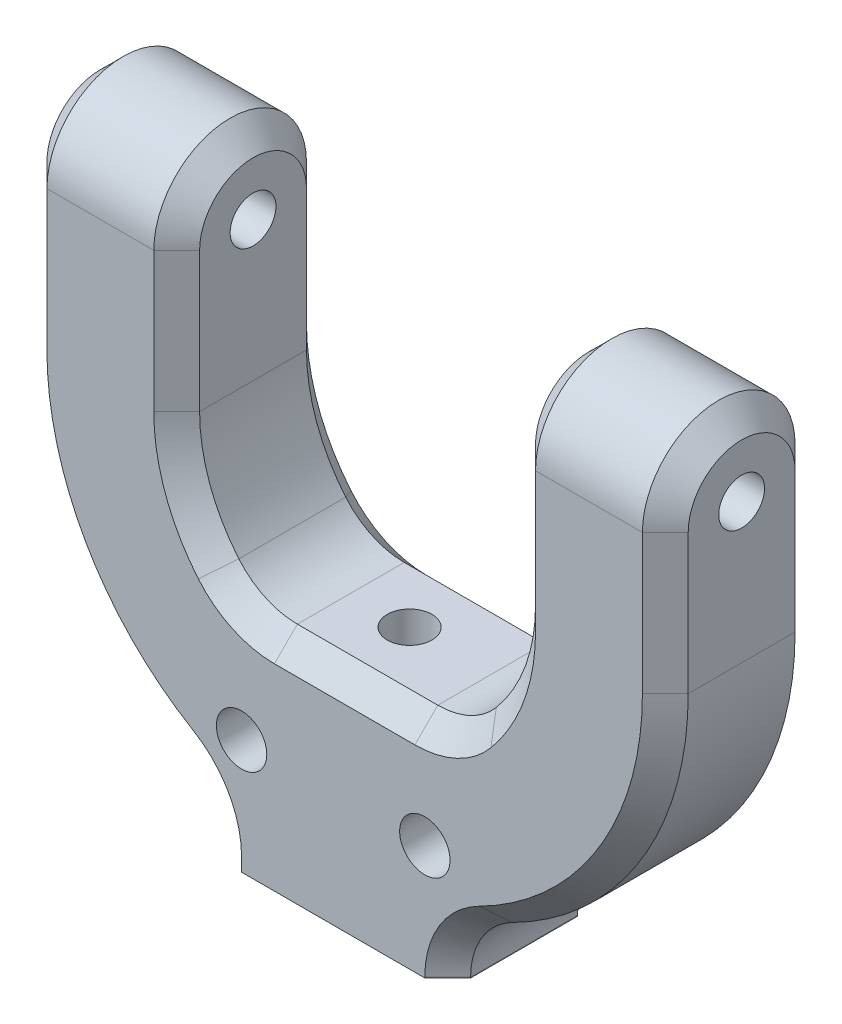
ISO-10303-21;
HEADER;
FILE_DESCRIPTION(('STEP AP214'),'2;1');
FILE_NAME('part.step','',(''),(''),'','','');
FILE_SCHEMA(('AUTOMOTIVE_DESIGN { 1 0 10303 214 1 1 1 1 }'));
ENDSEC;
DATA;
#1=APPLICATION_CONTEXT('core data for automotive mechanical design processes');
#2=APPLICATION_PROTOCOL_DEFINITION('international standard','automotive_design',2000,#1);
#3=PRODUCT_CONTEXT('',#1,'mechanical');
#4=PRODUCT('Part','Part','',(#3));
#5=PRODUCT_RELATED_PRODUCT_CATEGORY('part','',(#4));
#6=PRODUCT_DEFINITION_FORMATION('','',#4);
#7=PRODUCT_DEFINITION_CONTEXT('part definition',#1,'design');
#8=PRODUCT_DEFINITION('design','',#6,#7);
#9=PRODUCT_DEFINITION_SHAPE('','',#8);
#10=(LENGTH_UNIT() NAMED_UNIT(*) SI_UNIT(.MILLI.,.METRE.));
#11=(NAMED_UNIT(*) PLANE_ANGLE_UNIT() SI_UNIT($,.RADIAN.));
#12=(NAMED_UNIT(*) SI_UNIT($,.STERADIAN.) SOLID_ANGLE_UNIT());
#13=UNCERTAINTY_MEASURE_WITH_UNIT(LENGTH_MEASURE(1.E-05),#10,'distance_accuracy_value','');
#14=(GEOMETRIC_REPRESENTATION_CONTEXT(3) GLOBAL_UNCERTAINTY_ASSIGNED_CONTEXT((#13)) GLOBAL_UNIT_ASSIGNED_CONTEXT((#10,
#11,#12)) REPRESENTATION_CONTEXT('',''));
#15=CARTESIAN_POINT('',(0.,0.,0.));
#16=DIRECTION('',(0.,0.,1.));
#17=DIRECTION('',(1.,0.,0.));
#18=AXIS2_PLACEMENT_3D('',#15,#16,#17);
#19=CARTESIAN_POINT('',(12.,-45.,15.));
#20=DIRECTION('',(0.,0.,-1.));
#21=DIRECTION('',(-1.,0.,0.));
#22=AXIS2_PLACEMENT_3D('',#19,#20,#21);
#23=CYLINDRICAL_SURFACE('',#22,3.3);
#24=CARTESIAN_POINT('',(12.,-45.,-10.));
#25=DIRECTION('',(0.,0.,-1.));
#26=DIRECTION('',(-1.,0.,0.));
#27=AXIS2_PLACEMENT_3D('',#24,#25,#26);
#28=CIRCLE('',#27,3.3);
#29=CARTESIAN_POINT('',(8.7,-45.,-10.));
#30=VERTEX_POINT('',#29);
#31=EDGE_CURVE('E546',#30,#30,#28,.T.);
#32=ORIENTED_EDGE('',*,*,#31,.T.);
#33=EDGE_LOOP('',(#32));
#34=FACE_BOUND('',#33,.T.);
#35=CARTESIAN_POINT('',(12.,-45.,10.));
#36=DIRECTION('',(0.,0.,1.));
#37=DIRECTION('',(1.,0.,0.));
#38=AXIS2_PLACEMENT_3D('',#35,#36,#37);
#39=CIRCLE('',#38,3.3);
#40=CARTESIAN_POINT('',(15.3,-45.,10.));
#41=VERTEX_POINT('',#40);
#42=EDGE_CURVE('E541',#41,#41,#39,.T.);
#43=ORIENTED_EDGE('',*,*,#42,.T.);
#44=EDGE_LOOP('',(#43));
#45=FACE_BOUND('',#44,.T.);
#46=ADVANCED_FACE('F34',(#34,#45),#23,.F.);
#47=CARTESIAN_POINT('',(-40.5,4.79268292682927,0.));
#48=DIRECTION('',(1.,0.,0.));
#49=DIRECTION('',(0.,1.,0.));
#50=AXIS2_PLACEMENT_3D('',#47,#48,#49);
#51=CYLINDRICAL_SURFACE('',#50,10.);
#52=DIRECTION('',(1.,0.,0.));
#53=VECTOR('',#52,1.);
#54=CARTESIAN_POINT('',(-40.5,4.79268292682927,-10.));
#55=LINE('',#54,#53);
#56=CARTESIAN_POINT('',(-37.5,4.79268292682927,-10.));
#57=VERTEX_POINT('',#56);
#58=CARTESIAN_POINT('',(-23.5,4.79268292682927,-10.));
#59=VERTEX_POINT('',#58);
#60=EDGE_CURVE('E268',#57,#59,#55,.T.);
#61=ORIENTED_EDGE('',*,*,#60,.F.);
#62=CARTESIAN_POINT('',(-37.5,4.79268292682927,0.));
#63=DIRECTION('',(1.,0.,0.));
#64=DIRECTION('',(0.,0.,-1.));
#65=AXIS2_PLACEMENT_3D('',#62,#63,#64);
#66=CIRCLE('',#65,10.);
#67=CARTESIAN_POINT('',(-37.5,4.79268292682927,10.));
#68=VERTEX_POINT('',#67);
#69=EDGE_CURVE('E282',#57,#68,#66,.T.);
#70=ORIENTED_EDGE('',*,*,#69,.T.);
#71=DIRECTION('',(1.,0.,0.));
#72=VECTOR('',#71,1.);
#73=CARTESIAN_POINT('',(-40.5,4.79268292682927,10.));
#74=LINE('',#73,#72);
#75=CARTESIAN_POINT('',(-23.5,4.79268292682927,10.));
#76=VERTEX_POINT('',#75);
#77=EDGE_CURVE('E550',#68,#76,#74,.T.);
#78=ORIENTED_EDGE('',*,*,#77,.T.);
#79=CARTESIAN_POINT('',(-23.5,4.79268292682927,0.));
#80=DIRECTION('',(-1.,0.,0.));
#81=DIRECTION('',(0.,-1.,0.));
#82=AXIS2_PLACEMENT_3D('',#79,#80,#81);
#83=CIRCLE('',#82,10.);
#84=EDGE_CURVE('E285',#76,#59,#83,.T.);
#85=ORIENTED_EDGE('',*,*,#84,.T.);
#86=EDGE_LOOP('',(#61,#70,#78,#85));
#87=FACE_BOUND('',#86,.T.);
#88=ADVANCED_FACE('F280',(#87),#51,.T.);
#89=CARTESIAN_POINT('',(26.5,4.79268292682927,10.));
#90=VERTEX_POINT('',#89);
#91=CARTESIAN_POINT('',(40.5,4.79268292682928,10.));
#92=VERTEX_POINT('',#91);
#93=EDGE_CURVE('E286',#90,#92,#74,.T.);
#94=ORIENTED_EDGE('',*,*,#93,.T.);
#95=CARTESIAN_POINT('',(40.5,4.79268292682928,0.));
#96=DIRECTION('',(-1.,0.,0.));
#97=DIRECTION('',(0.,0.,1.));
#98=AXIS2_PLACEMENT_3D('',#95,#96,#97);
#99=CIRCLE('',#98,10.);
#100=CARTESIAN_POINT('',(40.5,4.79268292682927,-10.));
#101=VERTEX_POINT('',#100);
#102=EDGE_CURVE('E448',#92,#101,#99,.T.);
#103=ORIENTED_EDGE('',*,*,#102,.T.);
#104=CARTESIAN_POINT('',(26.5,4.79268292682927,-10.));
#105=VERTEX_POINT('',#104);
#106=EDGE_CURVE('E287',#105,#101,#55,.T.);
#107=ORIENTED_EDGE('',*,*,#106,.F.);
#108=CARTESIAN_POINT('',(26.5,4.79268292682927,0.));
#109=DIRECTION('',(1.,0.,0.));
#110=DIRECTION('',(0.,0.,-1.));
#111=AXIS2_PLACEMENT_3D('',#108,#109,#110);
#112=CIRCLE('',#111,10.);
#113=EDGE_CURVE('E450',#105,#90,#112,.T.);
#114=ORIENTED_EDGE('',*,*,#113,.T.);
#115=EDGE_LOOP('',(#94,#103,#107,#114));
#116=FACE_BOUND('',#115,.T.);
#117=ADVANCED_FACE('F710',(#116),#51,.T.);
#118=CARTESIAN_POINT('',(-40.5,-67.2361682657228,10.));
#119=DIRECTION('',(0.,0.,1.));
#120=DIRECTION('',(1.,0.,0.));
#121=AXIS2_PLACEMENT_3D('',#118,#119,#120);
#122=PLANE('',#121);
#123=DIRECTION('',(1.,0.,0.));
#124=VECTOR('',#123,1.);
#125=CARTESIAN_POINT('',(15.,-60.,10.));
#126=LINE('',#125,#124);
#127=CARTESIAN_POINT('',(-12.,-60.,10.));
#128=VERTEX_POINT('',#127);
#129=CARTESIAN_POINT('',(12.,-60.,10.));
#130=VERTEX_POINT('',#129);
#131=EDGE_CURVE('E603',#128,#130,#126,.T.);
#132=ORIENTED_EDGE('',*,*,#131,.T.);
#133=DIRECTION('',(0.,1.,0.));
#134=VECTOR('',#133,1.);
#135=CARTESIAN_POINT('',(12.,-59.8869593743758,10.));
#136=LINE('',#135,#134);
#137=CARTESIAN_POINT('',(12.,-59.8869593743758,10.));
#138=VERTEX_POINT('',#137);
#139=EDGE_CURVE('E452',#130,#138,#136,.T.);
#140=ORIENTED_EDGE('',*,*,#139,.T.);
#141=CARTESIAN_POINT('',(25.,-59.8869593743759,10.));
#142=DIRECTION('',(0.,0.,1.));
#143=DIRECTION('',(1.,0.,0.));
#144=AXIS2_PLACEMENT_3D('',#141,#142,#143);
#145=CIRCLE('',#144,13.);
#146=CARTESIAN_POINT('',(19.125,-48.2902195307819,10.));
#147=VERTEX_POINT('',#146);
#148=EDGE_CURVE('E454',#138,#147,#145,.F.);
#149=ORIENTED_EDGE('',*,*,#148,.T.);
#150=CARTESIAN_POINT('',(1.5,-13.5,10.));
#151=DIRECTION('',(0.,0.,1.));
#152=DIRECTION('',(1.,0.,0.));
#153=AXIS2_PLACEMENT_3D('',#150,#151,#152);
#154=CIRCLE('',#153,39.);
#155=CARTESIAN_POINT('',(40.5,-13.5,10.));
#156=VERTEX_POINT('',#155);
#157=EDGE_CURVE('E458',#147,#156,#154,.T.);
#158=ORIENTED_EDGE('',*,*,#157,.T.);
#159=DIRECTION('',(0.,1.,0.));
#160=VECTOR('',#159,1.);
#161=CARTESIAN_POINT('',(40.5,4.79268292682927,10.));
#162=LINE('',#161,#160);
#163=EDGE_CURVE('E456',#156,#92,#162,.T.);
#164=ORIENTED_EDGE('',*,*,#163,.T.);
#165=ORIENTED_EDGE('',*,*,#93,.F.);
#166=DIRECTION('',(0.,-1.,0.));
#167=VECTOR('',#166,1.);
#168=CARTESIAN_POINT('',(26.5,-13.5,10.));
#169=LINE('',#168,#167);
#170=CARTESIAN_POINT('',(26.5,-13.5,10.));
#171=VERTEX_POINT('',#170);
#172=EDGE_CURVE('E468',#90,#171,#169,.T.);
#173=ORIENTED_EDGE('',*,*,#172,.T.);
#174=CARTESIAN_POINT('',(1.5,-13.5,10.));
#175=DIRECTION('',(0.,0.,1.));
#176=DIRECTION('',(1.,0.,0.));
#177=AXIS2_PLACEMENT_3D('',#174,#175,#176);
#178=CIRCLE('',#177,25.);
#179=CARTESIAN_POINT('',(20.6618272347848,-29.5569105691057,10.));
#180=VERTEX_POINT('',#179);
#181=EDGE_CURVE('E470',#171,#180,#178,.F.);
#182=ORIENTED_EDGE('',*,*,#181,.T.);
#183=CARTESIAN_POINT('',(10.6976770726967,-21.2073170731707,10.));
#184=DIRECTION('',(0.,0.,1.));
#185=DIRECTION('',(1.,0.,0.));
#186=AXIS2_PLACEMENT_3D('',#183,#184,#185);
#187=CIRCLE('',#186,13.);
#188=CARTESIAN_POINT('',(10.6976770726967,-34.2073170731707,10.));
#189=VERTEX_POINT('',#188);
#190=EDGE_CURVE('E472',#180,#189,#187,.F.);
#191=ORIENTED_EDGE('',*,*,#190,.T.);
#192=DIRECTION('',(-1.,0.,0.));
#193=VECTOR('',#192,1.);
#194=CARTESIAN_POINT('',(-7.69767707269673,-34.2073170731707,10.));
#195=LINE('',#194,#193);
#196=CARTESIAN_POINT('',(-7.69767707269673,-34.2073170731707,10.));
#197=VERTEX_POINT('',#196);
#198=EDGE_CURVE('E474',#189,#197,#195,.T.);
#199=ORIENTED_EDGE('',*,*,#198,.T.);
#200=CARTESIAN_POINT('',(-7.69767707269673,-21.2073170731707,10.));
#201=DIRECTION('',(0.,0.,1.));
#202=DIRECTION('',(1.,0.,0.));
#203=AXIS2_PLACEMENT_3D('',#200,#201,#202);
#204=CIRCLE('',#203,13.);
#205=CARTESIAN_POINT('',(-17.6618272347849,-29.5569105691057,10.));
#206=VERTEX_POINT('',#205);
#207=EDGE_CURVE('E476',#197,#206,#204,.F.);
#208=ORIENTED_EDGE('',*,*,#207,.T.);
#209=CARTESIAN_POINT('',(1.5,-13.5,10.));
#210=DIRECTION('',(0.,0.,1.));
#211=DIRECTION('',(1.,0.,0.));
#212=AXIS2_PLACEMENT_3D('',#209,#210,#211);
#213=CIRCLE('',#212,25.);
#214=CARTESIAN_POINT('',(-23.5,-13.5,10.));
#215=VERTEX_POINT('',#214);
#216=EDGE_CURVE('E480',#206,#215,#213,.F.);
#217=ORIENTED_EDGE('',*,*,#216,.T.);
#218=DIRECTION('',(0.,1.,0.));
#219=VECTOR('',#218,1.);
#220=CARTESIAN_POINT('',(-23.5,4.79268292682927,10.));
#221=LINE('',#220,#219);
#222=EDGE_CURVE('E478',#215,#76,#221,.T.);
#223=ORIENTED_EDGE('',*,*,#222,.T.);
#224=ORIENTED_EDGE('',*,*,#77,.F.);
#225=DIRECTION('',(0.,-1.,0.));
#226=VECTOR('',#225,1.);
#227=CARTESIAN_POINT('',(-37.5,-13.5,10.));
#228=LINE('',#227,#226);
#229=CARTESIAN_POINT('',(-37.5,-13.5,10.));
#230=VERTEX_POINT('',#229);
#231=EDGE_CURVE('E462',#68,#230,#228,.T.);
#232=ORIENTED_EDGE('',*,*,#231,.T.);
#233=CARTESIAN_POINT('',(1.5,-13.5,10.));
#234=DIRECTION('',(0.,0.,1.));
#235=DIRECTION('',(1.,0.,0.));
#236=AXIS2_PLACEMENT_3D('',#233,#234,#235);
#237=CIRCLE('',#236,39.);
#238=CARTESIAN_POINT('',(-18.375,-47.0556906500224,10.));
#239=VERTEX_POINT('',#238);
#240=EDGE_CURVE('E466',#230,#239,#237,.T.);
#241=ORIENTED_EDGE('',*,*,#240,.T.);
#242=CARTESIAN_POINT('',(-25.,-58.2409208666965,10.));
#243=DIRECTION('',(0.,0.,1.));
#244=DIRECTION('',(1.,0.,0.));
#245=AXIS2_PLACEMENT_3D('',#242,#243,#244);
#246=CIRCLE('',#245,13.);
#247=CARTESIAN_POINT('',(-12.,-58.2409208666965,10.));
#248=VERTEX_POINT('',#247);
#249=EDGE_CURVE('E464',#239,#248,#246,.F.);
#250=ORIENTED_EDGE('',*,*,#249,.T.);
#251=DIRECTION('',(0.,-1.,0.));
#252=VECTOR('',#251,1.);
#253=CARTESIAN_POINT('',(-12.,-60.,10.));
#254=LINE('',#253,#252);
#255=EDGE_CURVE('E460',#248,#128,#254,.T.);
#256=ORIENTED_EDGE('',*,*,#255,.T.);
#257=EDGE_LOOP('',(#132,#140,#149,#158,#164,#165,#173,#182,#191,#199,#208,#217,#223,#224,#232,
#241,#250,#256));
#258=FACE_BOUND('',#257,.T.);
#259=CARTESIAN_POINT('',(-12.,-45.,10.));
#260=DIRECTION('',(0.,0.,1.));
#261=DIRECTION('',(1.,0.,0.));
#262=AXIS2_PLACEMENT_3D('',#259,#260,#261);
#263=CIRCLE('',#262,3.3);
#264=CARTESIAN_POINT('',(-8.7,-45.,10.));
#265=VERTEX_POINT('',#264);
#266=EDGE_CURVE('E544',#265,#265,#263,.T.);
#267=ORIENTED_EDGE('',*,*,#266,.F.);
#268=EDGE_LOOP('',(#267));
#269=FACE_BOUND('',#268,.T.);
#270=ORIENTED_EDGE('',*,*,#42,.F.);
#271=EDGE_LOOP('',(#270));
#272=FACE_BOUND('',#271,.T.);
#273=ADVANCED_FACE('F665',(#258,#269,#272),#122,.T.);
#274=CARTESIAN_POINT('',(-40.5,-67.2361682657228,-10.));
#275=DIRECTION('',(0.,0.,-1.));
#276=DIRECTION('',(-1.,0.,0.));
#277=AXIS2_PLACEMENT_3D('',#274,#275,#276);
#278=PLANE('',#277);
#279=CARTESIAN_POINT('',(-12.,-45.,-10.));
#280=DIRECTION('',(0.,0.,-1.));
#281=DIRECTION('',(-1.,0.,0.));
#282=AXIS2_PLACEMENT_3D('',#279,#280,#281);
#283=CIRCLE('',#282,3.3);
#284=CARTESIAN_POINT('',(-15.3,-45.,-10.));
#285=VERTEX_POINT('',#284);
#286=EDGE_CURVE('E549',#285,#285,#283,.T.);
#287=ORIENTED_EDGE('',*,*,#286,.F.);
#288=EDGE_LOOP('',(#287));
#289=FACE_BOUND('',#288,.T.);
#290=ORIENTED_EDGE('',*,*,#31,.F.);
#291=EDGE_LOOP('',(#290));
#292=FACE_BOUND('',#291,.T.);
#293=CARTESIAN_POINT('',(25.,-59.8869593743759,-10.));
#294=DIRECTION('',(0.,0.,-1.));
#295=DIRECTION('',(-1.,0.,0.));
#296=AXIS2_PLACEMENT_3D('',#293,#294,#295);
#297=CIRCLE('',#296,13.);
#298=CARTESIAN_POINT('',(19.125,-48.2902195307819,-10.));
#299=VERTEX_POINT('',#298);
#300=CARTESIAN_POINT('',(12.,-59.8869593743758,-10.));
#301=VERTEX_POINT('',#300);
#302=EDGE_CURVE('E511',#299,#301,#297,.F.);
#303=ORIENTED_EDGE('',*,*,#302,.T.);
#304=DIRECTION('',(0.,-1.,0.));
#305=VECTOR('',#304,1.);
#306=CARTESIAN_POINT('',(12.,-60.,-10.));
#307=LINE('',#306,#305);
#308=CARTESIAN_POINT('',(12.,-60.,-10.));
#309=VERTEX_POINT('',#308);
#310=EDGE_CURVE('E508',#301,#309,#307,.T.);
#311=ORIENTED_EDGE('',*,*,#310,.T.);
#312=DIRECTION('',(-1.,0.,0.));
#313=VECTOR('',#312,1.);
#314=CARTESIAN_POINT('',(15.,-60.,-10.));
#315=LINE('',#314,#313);
#316=CARTESIAN_POINT('',(-12.,-60.,-10.));
#317=VERTEX_POINT('',#316);
#318=EDGE_CURVE('E545',#309,#317,#315,.T.);
#319=ORIENTED_EDGE('',*,*,#318,.T.);
#320=DIRECTION('',(0.,1.,0.));
#321=VECTOR('',#320,1.);
#322=CARTESIAN_POINT('',(-12.,-58.2409208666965,-10.));
#323=LINE('',#322,#321);
#324=CARTESIAN_POINT('',(-12.,-58.2409208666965,-10.));
#325=VERTEX_POINT('',#324);
#326=EDGE_CURVE('E517',#317,#325,#323,.T.);
#327=ORIENTED_EDGE('',*,*,#326,.T.);
#328=CARTESIAN_POINT('',(-25.,-58.2409208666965,-10.));
#329=DIRECTION('',(0.,0.,-1.));
#330=DIRECTION('',(-1.,0.,0.));
#331=AXIS2_PLACEMENT_3D('',#328,#329,#330);
#332=CIRCLE('',#331,13.);
#333=CARTESIAN_POINT('',(-18.375,-47.0556906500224,-10.));
#334=VERTEX_POINT('',#333);
#335=EDGE_CURVE('E520',#325,#334,#332,.F.);
#336=ORIENTED_EDGE('',*,*,#335,.T.);
#337=CARTESIAN_POINT('',(1.5,-13.5,-10.));
#338=DIRECTION('',(0.,0.,-1.));
#339=DIRECTION('',(-1.,0.,0.));
#340=AXIS2_PLACEMENT_3D('',#337,#338,#339);
#341=CIRCLE('',#340,39.);
#342=CARTESIAN_POINT('',(-37.5,-13.5,-10.));
#343=VERTEX_POINT('',#342);
#344=EDGE_CURVE('E271',#334,#343,#341,.T.);
#345=ORIENTED_EDGE('',*,*,#344,.T.);
#346=DIRECTION('',(0.,1.,0.));
#347=VECTOR('',#346,1.);
#348=CARTESIAN_POINT('',(-37.5,4.79268292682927,-10.));
#349=LINE('',#348,#347);
#350=EDGE_CURVE('E265',#343,#57,#349,.T.);
#351=ORIENTED_EDGE('',*,*,#350,.T.);
#352=ORIENTED_EDGE('',*,*,#60,.T.);
#353=DIRECTION('',(0.,-1.,0.));
#354=VECTOR('',#353,1.);
#355=CARTESIAN_POINT('',(-23.5,-13.5,-10.));
#356=LINE('',#355,#354);
#357=CARTESIAN_POINT('',(-23.5,-13.5,-10.));
#358=VERTEX_POINT('',#357);
#359=EDGE_CURVE('E535',#59,#358,#356,.T.);
#360=ORIENTED_EDGE('',*,*,#359,.T.);
#361=CARTESIAN_POINT('',(1.5,-13.5,-10.));
#362=DIRECTION('',(0.,0.,-1.));
#363=DIRECTION('',(-1.,0.,0.));
#364=AXIS2_PLACEMENT_3D('',#361,#362,#363);
#365=CIRCLE('',#364,25.);
#366=CARTESIAN_POINT('',(-17.6618272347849,-29.5569105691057,-10.));
#367=VERTEX_POINT('',#366);
#368=EDGE_CURVE('E533',#358,#367,#365,.F.);
#369=ORIENTED_EDGE('',*,*,#368,.T.);
#370=CARTESIAN_POINT('',(-7.69767707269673,-21.2073170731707,-10.));
#371=DIRECTION('',(0.,0.,-1.));
#372=DIRECTION('',(-1.,0.,0.));
#373=AXIS2_PLACEMENT_3D('',#370,#371,#372);
#374=CIRCLE('',#373,13.);
#375=CARTESIAN_POINT('',(-7.69767707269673,-34.2073170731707,-10.));
#376=VERTEX_POINT('',#375);
#377=EDGE_CURVE('E531',#367,#376,#374,.F.);
#378=ORIENTED_EDGE('',*,*,#377,.T.);
#379=DIRECTION('',(1.,0.,0.));
#380=VECTOR('',#379,1.);
#381=CARTESIAN_POINT('',(10.6976770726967,-34.2073170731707,-10.));
#382=LINE('',#381,#380);
#383=CARTESIAN_POINT('',(10.6976770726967,-34.2073170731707,-10.));
#384=VERTEX_POINT('',#383);
#385=EDGE_CURVE('E529',#376,#384,#382,.T.);
#386=ORIENTED_EDGE('',*,*,#385,.T.);
#387=CARTESIAN_POINT('',(10.6976770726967,-21.2073170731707,-10.));
#388=DIRECTION('',(0.,0.,-1.));
#389=DIRECTION('',(-1.,0.,0.));
#390=AXIS2_PLACEMENT_3D('',#387,#388,#389);
#391=CIRCLE('',#390,13.);
#392=CARTESIAN_POINT('',(20.6618272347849,-29.5569105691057,-10.));
#393=VERTEX_POINT('',#392);
#394=EDGE_CURVE('E527',#384,#393,#391,.F.);
#395=ORIENTED_EDGE('',*,*,#394,.T.);
#396=CARTESIAN_POINT('',(1.5,-13.5,-10.));
#397=DIRECTION('',(0.,0.,-1.));
#398=DIRECTION('',(-1.,0.,0.));
#399=AXIS2_PLACEMENT_3D('',#396,#397,#398);
#400=CIRCLE('',#399,25.);
#401=CARTESIAN_POINT('',(26.5,-13.5,-10.));
#402=VERTEX_POINT('',#401);
#403=EDGE_CURVE('E524',#393,#402,#400,.F.);
#404=ORIENTED_EDGE('',*,*,#403,.T.);
#405=DIRECTION('',(0.,1.,0.));
#406=VECTOR('',#405,1.);
#407=CARTESIAN_POINT('',(26.5,4.79268292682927,-10.));
#408=LINE('',#407,#406);
#409=EDGE_CURVE('E276',#402,#105,#408,.T.);
#410=ORIENTED_EDGE('',*,*,#409,.T.);
#411=ORIENTED_EDGE('',*,*,#106,.T.);
#412=DIRECTION('',(0.,-1.,0.));
#413=VECTOR('',#412,1.);
#414=CARTESIAN_POINT('',(40.5,-13.5,-10.));
#415=LINE('',#414,#413);
#416=CARTESIAN_POINT('',(40.5,-13.5,-10.));
#417=VERTEX_POINT('',#416);
#418=EDGE_CURVE('E515',#101,#417,#415,.T.);
#419=ORIENTED_EDGE('',*,*,#418,.T.);
#420=CARTESIAN_POINT('',(1.5,-13.5,-10.));
#421=DIRECTION('',(0.,0.,-1.));
#422=DIRECTION('',(-1.,0.,0.));
#423=AXIS2_PLACEMENT_3D('',#420,#421,#422);
#424=CIRCLE('',#423,39.);
#425=EDGE_CURVE('E513',#417,#299,#424,.T.);
#426=ORIENTED_EDGE('',*,*,#425,.T.);
#427=EDGE_LOOP('',(#303,#311,#319,#327,#336,#345,#351,#352,#360,#369,#378,#386,#395,#404,#410,
#411,#419,#426));
#428=FACE_BOUND('',#427,.T.);
#429=ADVANCED_FACE('F267',(#289,#292,#428),#278,.T.);
#430=CARTESIAN_POINT('',(-12.,-45.,15.));
#431=DIRECTION('',(0.,0.,-1.));
#432=DIRECTION('',(-1.,0.,0.));
#433=AXIS2_PLACEMENT_3D('',#430,#431,#432);
#434=CYLINDRICAL_SURFACE('',#433,3.3);
#435=ORIENTED_EDGE('',*,*,#286,.T.);
#436=EDGE_LOOP('',(#435));
#437=FACE_BOUND('',#436,.T.);
#438=ORIENTED_EDGE('',*,*,#266,.T.);
#439=EDGE_LOOP('',(#438));
#440=FACE_BOUND('',#439,.T.);
#441=ADVANCED_FACE('F783',(#437,#440),#434,.F.);
#442=CARTESIAN_POINT('',(1.5,-13.5,15.));
#443=DIRECTION('',(0.,0.,-1.));
#444=DIRECTION('',(-1.,0.,0.));
#445=AXIS2_PLACEMENT_3D('',#442,#443,#444);
#446=CYLINDRICAL_SURFACE('',#445,22.);
#447=DIRECTION('',(0.,0.,-1.));
#448=VECTOR('',#447,1.);
#449=CARTESIAN_POINT('',(-15.3624079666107,-27.630081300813,15.));
#450=LINE('',#449,#448);
#451=CARTESIAN_POINT('',(-15.3624079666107,-27.630081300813,6.99999999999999));
#452=VERTEX_POINT('',#451);
#453=CARTESIAN_POINT('',(-15.3624079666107,-27.630081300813,-6.99999999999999));
#454=VERTEX_POINT('',#453);
#455=EDGE_CURVE('E593',#452,#454,#450,.T.);
#456=ORIENTED_EDGE('',*,*,#455,.T.);
#457=CARTESIAN_POINT('',(1.5,-13.5,-6.99999999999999));
#458=DIRECTION('',(0.,0.,-1.));
#459=DIRECTION('',(-1.,0.,0.));
#460=AXIS2_PLACEMENT_3D('',#457,#458,#459);
#461=CIRCLE('',#460,22.);
#462=CARTESIAN_POINT('',(-20.5,-13.5,-6.99999999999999));
#463=VERTEX_POINT('',#462);
#464=EDGE_CURVE('E404',#454,#463,#461,.T.);
#465=ORIENTED_EDGE('',*,*,#464,.T.);
#466=DIRECTION('',(0.,0.,-1.));
#467=VECTOR('',#466,1.);
#468=CARTESIAN_POINT('',(-20.5,-13.5,15.));
#469=LINE('',#468,#467);
#470=CARTESIAN_POINT('',(-20.5,-13.5,6.99999999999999));
#471=VERTEX_POINT('',#470);
#472=EDGE_CURVE('E537',#471,#463,#469,.T.);
#473=ORIENTED_EDGE('',*,*,#472,.F.);
#474=CARTESIAN_POINT('',(1.5,-13.5,6.99999999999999));
#475=DIRECTION('',(0.,0.,1.));
#476=DIRECTION('',(1.,0.,0.));
#477=AXIS2_PLACEMENT_3D('',#474,#475,#476);
#478=CIRCLE('',#477,22.);
#479=EDGE_CURVE('E406',#471,#452,#478,.T.);
#480=ORIENTED_EDGE('',*,*,#479,.T.);
#481=EDGE_LOOP('',(#456,#465,#473,#480));
#482=FACE_BOUND('',#481,.T.);
#483=ADVANCED_FACE('F744',(#482),#446,.F.);
#484=CARTESIAN_POINT('',(-20.5,-13.5,15.));
#485=DIRECTION('',(-1.,0.,0.));
#486=DIRECTION('',(0.,-1.,0.));
#487=AXIS2_PLACEMENT_3D('',#484,#485,#486);
#488=PLANE('',#487);
#489=CARTESIAN_POINT('',(-20.5,4.79268292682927,0.));
#490=DIRECTION('',(-1.,0.,0.));
#491=DIRECTION('',(0.,-1.,0.));
#492=AXIS2_PLACEMENT_3D('',#489,#490,#491);
#493=CIRCLE('',#492,3.);
#494=CARTESIAN_POINT('',(-20.5,1.79268292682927,0.));
#495=VERTEX_POINT('',#494);
#496=EDGE_CURVE('E554',#495,#495,#493,.T.);
#497=ORIENTED_EDGE('',*,*,#496,.T.);
#498=EDGE_LOOP('',(#497));
#499=FACE_BOUND('',#498,.T.);
#500=ORIENTED_EDGE('',*,*,#472,.T.);
#501=DIRECTION('',(0.,1.,0.));
#502=VECTOR('',#501,1.);
#503=CARTESIAN_POINT('',(-20.5,4.79268292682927,-6.99999999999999));
#504=LINE('',#503,#502);
#505=CARTESIAN_POINT('',(-20.5,4.79268292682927,-6.99999999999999));
#506=VERTEX_POINT('',#505);
#507=EDGE_CURVE('E12',#463,#506,#504,.T.);
#508=ORIENTED_EDGE('',*,*,#507,.T.);
#509=CARTESIAN_POINT('',(-20.5,4.79268292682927,0.));
#510=DIRECTION('',(-1.,0.,0.));
#511=DIRECTION('',(0.,-1.,0.));
#512=AXIS2_PLACEMENT_3D('',#509,#510,#511);
#513=CIRCLE('',#512,6.99999999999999);
#514=CARTESIAN_POINT('',(-20.5,4.79268292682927,6.99999999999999));
#515=VERTEX_POINT('',#514);
#516=EDGE_CURVE('E43',#506,#515,#513,.F.);
#517=ORIENTED_EDGE('',*,*,#516,.T.);
#518=DIRECTION('',(0.,-1.,0.));
#519=VECTOR('',#518,1.);
#520=CARTESIAN_POINT('',(-20.5,-13.5,6.99999999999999));
#521=LINE('',#520,#519);
#522=EDGE_CURVE('E402',#515,#471,#521,.T.);
#523=ORIENTED_EDGE('',*,*,#522,.T.);
#524=EDGE_LOOP('',(#500,#508,#517,#523));
#525=FACE_BOUND('',#524,.T.);
#526=ADVANCED_FACE('F1154',(#499,#525),#488,.F.);
#527=CARTESIAN_POINT('',(-40.5,-13.5,15.));
#528=DIRECTION('',(1.,0.,0.));
#529=DIRECTION('',(0.,0.,-1.));
#530=AXIS2_PLACEMENT_3D('',#527,#528,#529);
#531=PLANE('',#530);
#532=CARTESIAN_POINT('',(-40.5,4.79268292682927,0.));
#533=DIRECTION('',(1.,0.,0.));
#534=DIRECTION('',(0.,1.,0.));
#535=AXIS2_PLACEMENT_3D('',#532,#533,#534);
#536=CIRCLE('',#535,3.);
#537=CARTESIAN_POINT('',(-40.5,7.79268292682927,0.));
#538=VERTEX_POINT('',#537);
#539=EDGE_CURVE('E555',#538,#538,#536,.T.);
#540=ORIENTED_EDGE('',*,*,#539,.T.);
#541=EDGE_LOOP('',(#540));
#542=FACE_BOUND('',#541,.T.);
#543=CARTESIAN_POINT('',(-40.5,4.79268292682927,0.));
#544=DIRECTION('',(1.,0.,0.));
#545=DIRECTION('',(0.,0.,-1.));
#546=AXIS2_PLACEMENT_3D('',#543,#544,#545);
#547=CIRCLE('',#546,6.99999999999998);
#548=CARTESIAN_POINT('',(-40.5,4.79268292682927,6.99999999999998));
#549=VERTEX_POINT('',#548);
#550=CARTESIAN_POINT('',(-40.5,4.79268292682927,-6.99999999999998));
#551=VERTEX_POINT('',#550);
#552=EDGE_CURVE('E432',#549,#551,#547,.F.);
#553=ORIENTED_EDGE('',*,*,#552,.T.);
#554=DIRECTION('',(0.,-1.,0.));
#555=VECTOR('',#554,1.);
#556=CARTESIAN_POINT('',(-40.5,-13.5,-6.99999999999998));
#557=LINE('',#556,#555);
#558=CARTESIAN_POINT('',(-40.5,-13.5,-6.99999999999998));
#559=VERTEX_POINT('',#558);
#560=EDGE_CURVE('E301',#551,#559,#557,.T.);
#561=ORIENTED_EDGE('',*,*,#560,.T.);
#562=DIRECTION('',(0.,0.,-1.));
#563=VECTOR('',#562,1.);
#564=CARTESIAN_POINT('',(-40.5,-13.5,15.));
#565=LINE('',#564,#563);
#566=CARTESIAN_POINT('',(-40.5,-13.5,6.99999999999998));
#567=VERTEX_POINT('',#566);
#568=EDGE_CURVE('E557',#567,#559,#565,.T.);
#569=ORIENTED_EDGE('',*,*,#568,.F.);
#570=DIRECTION('',(0.,1.,0.));
#571=VECTOR('',#570,1.);
#572=CARTESIAN_POINT('',(-40.5,4.79268292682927,6.99999999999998));
#573=LINE('',#572,#571);
#574=EDGE_CURVE('E434',#567,#549,#573,.T.);
#575=ORIENTED_EDGE('',*,*,#574,.T.);
#576=EDGE_LOOP('',(#553,#561,#569,#575));
#577=FACE_BOUND('',#576,.T.);
#578=ADVANCED_FACE('F660',(#542,#577),#531,.F.);
#579=CARTESIAN_POINT('',(1.5,-13.5,15.));
#580=DIRECTION('',(0.,0.,-1.));
#581=DIRECTION('',(-1.,0.,0.));
#582=AXIS2_PLACEMENT_3D('',#579,#580,#581);
#583=CYLINDRICAL_SURFACE('',#582,42.);
#584=ORIENTED_EDGE('',*,*,#568,.T.);
#585=CARTESIAN_POINT('',(1.5,-13.5,-6.99999999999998));
#586=DIRECTION('',(0.,0.,-1.));
#587=DIRECTION('',(-1.,0.,0.));
#588=AXIS2_PLACEMENT_3D('',#585,#586,#587);
#589=CIRCLE('',#588,42.);
#590=CARTESIAN_POINT('',(-19.9038461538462,-49.636897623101,-6.99999999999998));
#591=VERTEX_POINT('',#590);
#592=EDGE_CURVE('E436',#559,#591,#589,.F.);
#593=ORIENTED_EDGE('',*,*,#592,.T.);
#594=DIRECTION('',(0.,0.,-1.));
#595=VECTOR('',#594,1.);
#596=CARTESIAN_POINT('',(-19.9038461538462,-49.636897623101,15.));
#597=LINE('',#596,#595);
#598=CARTESIAN_POINT('',(-19.9038461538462,-49.636897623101,6.99999999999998));
#599=VERTEX_POINT('',#598);
#600=EDGE_CURVE('E560',#599,#591,#597,.T.);
#601=ORIENTED_EDGE('',*,*,#600,.F.);
#602=CARTESIAN_POINT('',(1.5,-13.5,6.99999999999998));
#603=DIRECTION('',(0.,0.,1.));
#604=DIRECTION('',(1.,0.,0.));
#605=AXIS2_PLACEMENT_3D('',#602,#603,#604);
#606=CIRCLE('',#605,42.);
#607=EDGE_CURVE('E438',#599,#567,#606,.F.);
#608=ORIENTED_EDGE('',*,*,#607,.T.);
#609=EDGE_LOOP('',(#584,#593,#601,#608));
#610=FACE_BOUND('',#609,.T.);
#611=ADVANCED_FACE('F642',(#610),#583,.T.);
#612=CARTESIAN_POINT('',(-25.,-58.2409208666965,15.));
#613=DIRECTION('',(0.,0.,-1.));
#614=DIRECTION('',(-1.,0.,0.));
#615=AXIS2_PLACEMENT_3D('',#612,#613,#614);
#616=CYLINDRICAL_SURFACE('',#615,10.);
#617=ORIENTED_EDGE('',*,*,#600,.T.);
#618=CARTESIAN_POINT('',(-25.,-58.2409208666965,-6.99999999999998));
#619=DIRECTION('',(0.,0.,-1.));
#620=DIRECTION('',(-1.,0.,0.));
#621=AXIS2_PLACEMENT_3D('',#618,#619,#620);
#622=CIRCLE('',#621,10.);
#623=CARTESIAN_POINT('',(-15.,-58.2409208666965,-6.99999999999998));
#624=VERTEX_POINT('',#623);
#625=EDGE_CURVE('E440',#591,#624,#622,.T.);
#626=ORIENTED_EDGE('',*,*,#625,.T.);
#627=DIRECTION('',(0.,0.,-1.));
#628=VECTOR('',#627,1.);
#629=CARTESIAN_POINT('',(-15.,-58.2409208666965,15.));
#630=LINE('',#629,#628);
#631=CARTESIAN_POINT('',(-15.,-58.2409208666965,6.99999999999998));
#632=VERTEX_POINT('',#631);
#633=EDGE_CURVE('E563',#632,#624,#630,.T.);
#634=ORIENTED_EDGE('',*,*,#633,.F.);
#635=CARTESIAN_POINT('',(-25.,-58.2409208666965,6.99999999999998));
#636=DIRECTION('',(0.,0.,1.));
#637=DIRECTION('',(1.,0.,0.));
#638=AXIS2_PLACEMENT_3D('',#635,#636,#637);
#639=CIRCLE('',#638,10.);
#640=EDGE_CURVE('E442',#632,#599,#639,.T.);
#641=ORIENTED_EDGE('',*,*,#640,.T.);
#642=EDGE_LOOP('',(#617,#626,#634,#641));
#643=FACE_BOUND('',#642,.T.);
#644=ADVANCED_FACE('F646',(#643),#616,.F.);
#645=CARTESIAN_POINT('',(-15.,-60.,15.));
#646=DIRECTION('',(1.,0.,0.));
#647=DIRECTION('',(0.,0.,-1.));
#648=AXIS2_PLACEMENT_3D('',#645,#646,#647);
#649=PLANE('',#648);
#650=ORIENTED_EDGE('',*,*,#633,.T.);
#651=DIRECTION('',(0.,-1.,0.));
#652=VECTOR('',#651,1.);
#653=CARTESIAN_POINT('',(-15.,-60.,-6.99999999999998));
#654=LINE('',#653,#652);
#655=CARTESIAN_POINT('',(-15.,-60.,-6.99999999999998));
#656=VERTEX_POINT('',#655);
#657=EDGE_CURVE('E444',#624,#656,#654,.T.);
#658=ORIENTED_EDGE('',*,*,#657,.T.);
#659=DIRECTION('',(0.,0.,-1.));
#660=VECTOR('',#659,1.);
#661=CARTESIAN_POINT('',(-15.,-60.,15.));
#662=LINE('',#661,#660);
#663=CARTESIAN_POINT('',(-15.,-60.,6.99999999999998));
#664=VERTEX_POINT('',#663);
#665=EDGE_CURVE('E566',#664,#656,#662,.T.);
#666=ORIENTED_EDGE('',*,*,#665,.F.);
#667=DIRECTION('',(0.,1.,0.));
#668=VECTOR('',#667,1.);
#669=CARTESIAN_POINT('',(-15.,-58.2409208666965,6.99999999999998));
#670=LINE('',#669,#668);
#671=EDGE_CURVE('E446',#664,#632,#670,.T.);
#672=ORIENTED_EDGE('',*,*,#671,.T.);
#673=EDGE_LOOP('',(#650,#658,#666,#672));
#674=FACE_BOUND('',#673,.T.);
#675=ADVANCED_FACE('F624',(#674),#649,.F.);
#676=CARTESIAN_POINT('',(15.,-60.,15.));
#677=DIRECTION('',(0.,1.,0.));
#678=DIRECTION('',(-1.,0.,0.));
#679=AXIS2_PLACEMENT_3D('',#676,#677,#678);
#680=PLANE('',#679);
#681=CARTESIAN_POINT('',(0.,-60.,0.));
#682=DIRECTION('',(0.,-1.,0.));
#683=DIRECTION('',(1.,0.,0.));
#684=AXIS2_PLACEMENT_3D('',#681,#682,#683);
#685=CIRCLE('',#684,2.925);
#686=CARTESIAN_POINT('',(2.92500000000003,-60.,0.));
#687=VERTEX_POINT('',#686);
#688=EDGE_CURVE('E380',#687,#687,#685,.T.);
#689=ORIENTED_EDGE('',*,*,#688,.F.);
#690=EDGE_LOOP('',(#689));
#691=FACE_BOUND('',#690,.T.);
#692=ORIENTED_EDGE('',*,*,#318,.F.);
#693=DIRECTION('',(0.707106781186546,0.,0.707106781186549));
#694=VECTOR('',#693,1.);
#695=CARTESIAN_POINT('',(11.9999999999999,-60.,-10.0000000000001));
#696=LINE('',#695,#694);
#697=CARTESIAN_POINT('',(15.,-60.,-6.99999999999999));
#698=VERTEX_POINT('',#697);
#699=EDGE_CURVE('E500',#309,#698,#696,.T.);
#700=ORIENTED_EDGE('',*,*,#699,.T.);
#701=DIRECTION('',(0.,0.,-1.));
#702=VECTOR('',#701,1.);
#703=CARTESIAN_POINT('',(15.,-60.,15.));
#704=LINE('',#703,#702);
#705=CARTESIAN_POINT('',(15.,-60.,6.99999999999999));
#706=VERTEX_POINT('',#705);
#707=EDGE_CURVE('E569',#706,#698,#704,.T.);
#708=ORIENTED_EDGE('',*,*,#707,.F.);
#709=DIRECTION('',(-0.707106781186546,0.,0.707106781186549));
#710=VECTOR('',#709,1.);
#711=CARTESIAN_POINT('',(11.9999999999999,-60.,10.0000000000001));
#712=LINE('',#711,#710);
#713=EDGE_CURVE('E502',#706,#130,#712,.T.);
#714=ORIENTED_EDGE('',*,*,#713,.T.);
#715=ORIENTED_EDGE('',*,*,#131,.F.);
#716=DIRECTION('',(-0.707106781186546,0.,-0.707106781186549));
#717=VECTOR('',#716,1.);
#718=CARTESIAN_POINT('',(-12.,-60.,10.));
#719=LINE('',#718,#717);
#720=EDGE_CURVE('E506',#128,#664,#719,.T.);
#721=ORIENTED_EDGE('',*,*,#720,.T.);
#722=ORIENTED_EDGE('',*,*,#665,.T.);
#723=DIRECTION('',(0.707106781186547,0.,-0.707106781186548));
#724=VECTOR('',#723,1.);
#725=CARTESIAN_POINT('',(-12.,-60.,-10.));
#726=LINE('',#725,#724);
#727=EDGE_CURVE('E504',#656,#317,#726,.T.);
#728=ORIENTED_EDGE('',*,*,#727,.T.);
#729=EDGE_LOOP('',(#692,#700,#708,#714,#715,#721,#722,#728));
#730=FACE_BOUND('',#729,.T.);
#731=ADVANCED_FACE('F620',(#691,#730),#680,.F.);
#732=CARTESIAN_POINT('',(15.,-60.,15.));
#733=DIRECTION('',(-1.,0.,0.));
#734=DIRECTION('',(0.,-1.,0.));
#735=AXIS2_PLACEMENT_3D('',#732,#733,#734);
#736=PLANE('',#735);
#737=ORIENTED_EDGE('',*,*,#707,.T.);
#738=DIRECTION('',(0.,1.,0.));
#739=VECTOR('',#738,1.);
#740=CARTESIAN_POINT('',(15.,-59.8869593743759,-6.99999999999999));
#741=LINE('',#740,#739);
#742=CARTESIAN_POINT('',(15.,-59.8869593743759,-6.99999999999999));
#743=VERTEX_POINT('',#742);
#744=EDGE_CURVE('E496',#698,#743,#741,.T.);
#745=ORIENTED_EDGE('',*,*,#744,.T.);
#746=DIRECTION('',(0.,0.,-1.));
#747=VECTOR('',#746,1.);
#748=CARTESIAN_POINT('',(15.,-59.8869593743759,15.));
#749=LINE('',#748,#747);
#750=CARTESIAN_POINT('',(15.,-59.8869593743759,6.99999999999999));
#751=VERTEX_POINT('',#750);
#752=EDGE_CURVE('E572',#751,#743,#749,.T.);
#753=ORIENTED_EDGE('',*,*,#752,.F.);
#754=DIRECTION('',(0.,-1.,0.));
#755=VECTOR('',#754,1.);
#756=CARTESIAN_POINT('',(15.,-60.,6.99999999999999));
#757=LINE('',#756,#755);
#758=EDGE_CURVE('E498',#751,#706,#757,.T.);
#759=ORIENTED_EDGE('',*,*,#758,.T.);
#760=EDGE_LOOP('',(#737,#745,#753,#759));
#761=FACE_BOUND('',#760,.T.);
#762=ADVANCED_FACE('F623',(#761),#736,.F.);
#763=CARTESIAN_POINT('',(25.,-59.8869593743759,15.));
#764=DIRECTION('',(0.,0.,-1.));
#765=DIRECTION('',(-1.,0.,0.));
#766=AXIS2_PLACEMENT_3D('',#763,#764,#765);
#767=CYLINDRICAL_SURFACE('',#766,10.);
#768=ORIENTED_EDGE('',*,*,#752,.T.);
#769=CARTESIAN_POINT('',(25.,-59.8869593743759,-6.99999999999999));
#770=DIRECTION('',(0.,0.,-1.));
#771=DIRECTION('',(-1.,0.,0.));
#772=AXIS2_PLACEMENT_3D('',#769,#770,#771);
#773=CIRCLE('',#772,10.);
#774=CARTESIAN_POINT('',(20.4807692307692,-50.966390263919,-6.99999999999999));
#775=VERTEX_POINT('',#774);
#776=EDGE_CURVE('E492',#743,#775,#773,.T.);
#777=ORIENTED_EDGE('',*,*,#776,.T.);
#778=DIRECTION('',(0.,0.,-1.));
#779=VECTOR('',#778,1.);
#780=CARTESIAN_POINT('',(20.4807692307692,-50.966390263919,15.));
#781=LINE('',#780,#779);
#782=CARTESIAN_POINT('',(20.4807692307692,-50.966390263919,6.99999999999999));
#783=VERTEX_POINT('',#782);
#784=EDGE_CURVE('E575',#783,#775,#781,.T.);
#785=ORIENTED_EDGE('',*,*,#784,.F.);
#786=CARTESIAN_POINT('',(25.,-59.8869593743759,6.99999999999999));
#787=DIRECTION('',(0.,0.,1.));
#788=DIRECTION('',(1.,0.,0.));
#789=AXIS2_PLACEMENT_3D('',#786,#787,#788);
#790=CIRCLE('',#789,10.);
#791=EDGE_CURVE('E494',#783,#751,#790,.T.);
#792=ORIENTED_EDGE('',*,*,#791,.T.);
#793=EDGE_LOOP('',(#768,#777,#785,#792));
#794=FACE_BOUND('',#793,.T.);
#795=ADVANCED_FACE('F1204',(#794),#767,.F.);
#796=CARTESIAN_POINT('',(1.5,-13.5,15.));
#797=DIRECTION('',(0.,0.,-1.));
#798=DIRECTION('',(-1.,0.,0.));
#799=AXIS2_PLACEMENT_3D('',#796,#797,#798);
#800=CYLINDRICAL_SURFACE('',#799,42.);
#801=ORIENTED_EDGE('',*,*,#784,.T.);
#802=CARTESIAN_POINT('',(1.5,-13.5,-6.99999999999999));
#803=DIRECTION('',(0.,0.,-1.));
#804=DIRECTION('',(-1.,0.,0.));
#805=AXIS2_PLACEMENT_3D('',#802,#803,#804);
#806=CIRCLE('',#805,42.);
#807=CARTESIAN_POINT('',(43.5,-13.5,-6.99999999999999));
#808=VERTEX_POINT('',#807);
#809=EDGE_CURVE('E488',#775,#808,#806,.F.);
#810=ORIENTED_EDGE('',*,*,#809,.T.);
#811=DIRECTION('',(0.,0.,-1.));
#812=VECTOR('',#811,1.);
#813=CARTESIAN_POINT('',(43.5,-13.5,15.));
#814=LINE('',#813,#812);
#815=CARTESIAN_POINT('',(43.5,-13.5,6.99999999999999));
#816=VERTEX_POINT('',#815);
#817=EDGE_CURVE('E578',#816,#808,#814,.T.);
#818=ORIENTED_EDGE('',*,*,#817,.F.);
#819=CARTESIAN_POINT('',(1.5,-13.5,6.99999999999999));
#820=DIRECTION('',(0.,0.,1.));
#821=DIRECTION('',(1.,0.,0.));
#822=AXIS2_PLACEMENT_3D('',#819,#820,#821);
#823=CIRCLE('',#822,42.);
#824=EDGE_CURVE('E490',#816,#783,#823,.F.);
#825=ORIENTED_EDGE('',*,*,#824,.T.);
#826=EDGE_LOOP('',(#801,#810,#818,#825));
#827=FACE_BOUND('',#826,.T.);
#828=ADVANCED_FACE('F768',(#827),#800,.T.);
#829=CARTESIAN_POINT('',(43.5,-13.5,15.));
#830=DIRECTION('',(-1.,0.,0.));
#831=DIRECTION('',(0.,0.,1.));
#832=AXIS2_PLACEMENT_3D('',#829,#830,#831);
#833=PLANE('',#832);
#834=CARTESIAN_POINT('',(43.5,4.79268292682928,0.));
#835=DIRECTION('',(1.,0.,0.));
#836=DIRECTION('',(0.,1.,0.));
#837=AXIS2_PLACEMENT_3D('',#834,#835,#836);
#838=CIRCLE('',#837,3.);
#839=CARTESIAN_POINT('',(43.5,7.79268292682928,0.));
#840=VERTEX_POINT('',#839);
#841=EDGE_CURVE('E600',#840,#840,#838,.T.);
#842=ORIENTED_EDGE('',*,*,#841,.F.);
#843=EDGE_LOOP('',(#842));
#844=FACE_BOUND('',#843,.T.);
#845=ORIENTED_EDGE('',*,*,#817,.T.);
#846=DIRECTION('',(0.,1.,0.));
#847=VECTOR('',#846,1.);
#848=CARTESIAN_POINT('',(43.5,4.79268292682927,-6.99999999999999));
#849=LINE('',#848,#847);
#850=CARTESIAN_POINT('',(43.5,4.79268292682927,-6.99999999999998));
#851=VERTEX_POINT('',#850);
#852=EDGE_CURVE('E482',#808,#851,#849,.T.);
#853=ORIENTED_EDGE('',*,*,#852,.T.);
#854=CARTESIAN_POINT('',(43.5,4.79268292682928,0.));
#855=DIRECTION('',(-1.,0.,0.));
#856=DIRECTION('',(0.,0.,1.));
#857=AXIS2_PLACEMENT_3D('',#854,#855,#856);
#858=CIRCLE('',#857,6.99999999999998);
#859=CARTESIAN_POINT('',(43.5,4.79268292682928,6.99999999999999));
#860=VERTEX_POINT('',#859);
#861=EDGE_CURVE('E484',#851,#860,#858,.F.);
#862=ORIENTED_EDGE('',*,*,#861,.T.);
#863=DIRECTION('',(0.,-1.,0.));
#864=VECTOR('',#863,1.);
#865=CARTESIAN_POINT('',(43.5,-13.5,6.99999999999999));
#866=LINE('',#865,#864);
#867=EDGE_CURVE('E486',#860,#816,#866,.T.);
#868=ORIENTED_EDGE('',*,*,#867,.T.);
#869=EDGE_LOOP('',(#845,#853,#862,#868));
#870=FACE_BOUND('',#869,.T.);
#871=ADVANCED_FACE('F760',(#844,#870),#833,.F.);
#872=CARTESIAN_POINT('',(23.5,-13.5,15.));
#873=DIRECTION('',(1.,0.,0.));
#874=DIRECTION('',(0.,1.,0.));
#875=AXIS2_PLACEMENT_3D('',#872,#873,#874);
#876=PLANE('',#875);
#877=CARTESIAN_POINT('',(23.5,4.79268292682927,0.));
#878=DIRECTION('',(1.,0.,0.));
#879=DIRECTION('',(0.,1.,0.));
#880=AXIS2_PLACEMENT_3D('',#877,#878,#879);
#881=CIRCLE('',#880,3.);
#882=CARTESIAN_POINT('',(23.5,7.79268292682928,0.));
#883=VERTEX_POINT('',#882);
#884=EDGE_CURVE('E551',#883,#883,#881,.T.);
#885=ORIENTED_EDGE('',*,*,#884,.T.);
#886=EDGE_LOOP('',(#885));
#887=FACE_BOUND('',#886,.T.);
#888=CARTESIAN_POINT('',(23.5,4.79268292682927,0.));
#889=DIRECTION('',(1.,0.,0.));
#890=DIRECTION('',(0.,1.,0.));
#891=AXIS2_PLACEMENT_3D('',#888,#889,#890);
#892=CIRCLE('',#891,6.99999999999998);
#893=CARTESIAN_POINT('',(23.5,4.79268292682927,6.99999999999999));
#894=VERTEX_POINT('',#893);
#895=CARTESIAN_POINT('',(23.5,4.79268292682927,-6.99999999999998));
#896=VERTEX_POINT('',#895);
#897=EDGE_CURVE('E422',#894,#896,#892,.F.);
#898=ORIENTED_EDGE('',*,*,#897,.T.);
#899=DIRECTION('',(0.,-1.,0.));
#900=VECTOR('',#899,1.);
#901=CARTESIAN_POINT('',(23.5,-13.5,-6.99999999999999));
#902=LINE('',#901,#900);
#903=CARTESIAN_POINT('',(23.5,-13.5,-6.99999999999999));
#904=VERTEX_POINT('',#903);
#905=EDGE_CURVE('E420',#896,#904,#902,.T.);
#906=ORIENTED_EDGE('',*,*,#905,.T.);
#907=DIRECTION('',(0.,0.,-1.));
#908=VECTOR('',#907,1.);
#909=CARTESIAN_POINT('',(23.5,-13.5,15.));
#910=LINE('',#909,#908);
#911=CARTESIAN_POINT('',(23.5,-13.5,6.99999999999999));
#912=VERTEX_POINT('',#911);
#913=EDGE_CURVE('E581',#912,#904,#910,.T.);
#914=ORIENTED_EDGE('',*,*,#913,.F.);
#915=DIRECTION('',(0.,1.,0.));
#916=VECTOR('',#915,1.);
#917=CARTESIAN_POINT('',(23.5,4.79268292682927,6.99999999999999));
#918=LINE('',#917,#916);
#919=EDGE_CURVE('E424',#912,#894,#918,.T.);
#920=ORIENTED_EDGE('',*,*,#919,.T.);
#921=EDGE_LOOP('',(#898,#906,#914,#920));
#922=FACE_BOUND('',#921,.T.);
#923=ADVANCED_FACE('F758',(#887,#922),#876,.F.);
#924=CARTESIAN_POINT('',(1.5,-13.5,15.));
#925=DIRECTION('',(0.,0.,-1.));
#926=DIRECTION('',(-1.,0.,0.));
#927=AXIS2_PLACEMENT_3D('',#924,#925,#926);
#928=CYLINDRICAL_SURFACE('',#927,22.);
#929=ORIENTED_EDGE('',*,*,#913,.T.);
#930=CARTESIAN_POINT('',(1.5,-13.5,-6.99999999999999));
#931=DIRECTION('',(0.,0.,-1.));
#932=DIRECTION('',(-1.,0.,0.));
#933=AXIS2_PLACEMENT_3D('',#930,#931,#932);
#934=CIRCLE('',#933,22.);
#935=CARTESIAN_POINT('',(18.3624079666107,-27.630081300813,-6.99999999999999));
#936=VERTEX_POINT('',#935);
#937=EDGE_CURVE('E426',#904,#936,#934,.T.);
#938=ORIENTED_EDGE('',*,*,#937,.T.);
#939=DIRECTION('',(0.,0.,-1.));
#940=VECTOR('',#939,1.);
#941=CARTESIAN_POINT('',(18.3624079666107,-27.630081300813,15.));
#942=LINE('',#941,#940);
#943=CARTESIAN_POINT('',(18.3624079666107,-27.630081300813,6.99999999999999));
#944=VERTEX_POINT('',#943);
#945=EDGE_CURVE('E584',#944,#936,#942,.T.);
#946=ORIENTED_EDGE('',*,*,#945,.F.);
#947=CARTESIAN_POINT('',(1.5,-13.5,6.99999999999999));
#948=DIRECTION('',(0.,0.,1.));
#949=DIRECTION('',(1.,0.,0.));
#950=AXIS2_PLACEMENT_3D('',#947,#948,#949);
#951=CIRCLE('',#950,22.);
#952=EDGE_CURVE('E298',#944,#912,#951,.T.);
#953=ORIENTED_EDGE('',*,*,#952,.T.);
#954=EDGE_LOOP('',(#929,#938,#946,#953));
#955=FACE_BOUND('',#954,.T.);
#956=ADVANCED_FACE('F755',(#955),#928,.F.);
#957=CARTESIAN_POINT('',(10.6976770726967,-21.2073170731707,15.));
#958=DIRECTION('',(0.,0.,-1.));
#959=DIRECTION('',(-1.,0.,0.));
#960=AXIS2_PLACEMENT_3D('',#957,#958,#959);
#961=CYLINDRICAL_SURFACE('',#960,10.);
#962=ORIENTED_EDGE('',*,*,#945,.T.);
#963=CARTESIAN_POINT('',(10.6976770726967,-21.2073170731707,-6.99999999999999));
#964=DIRECTION('',(0.,0.,-1.));
#965=DIRECTION('',(-1.,0.,0.));
#966=AXIS2_PLACEMENT_3D('',#963,#964,#965);
#967=CIRCLE('',#966,10.);
#968=CARTESIAN_POINT('',(10.6976770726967,-31.2073170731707,-6.99999999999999));
#969=VERTEX_POINT('',#968);
#970=EDGE_CURVE('E416',#936,#969,#967,.T.);
#971=ORIENTED_EDGE('',*,*,#970,.T.);
#972=DIRECTION('',(0.,0.,-1.));
#973=VECTOR('',#972,1.);
#974=CARTESIAN_POINT('',(10.6976770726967,-31.2073170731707,15.));
#975=LINE('',#974,#973);
#976=CARTESIAN_POINT('',(10.6976770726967,-31.2073170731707,6.99999999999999));
#977=VERTEX_POINT('',#976);
#978=EDGE_CURVE('E587',#977,#969,#975,.T.);
#979=ORIENTED_EDGE('',*,*,#978,.F.);
#980=CARTESIAN_POINT('',(10.6976770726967,-21.2073170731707,6.99999999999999));
#981=DIRECTION('',(0.,0.,1.));
#982=DIRECTION('',(1.,0.,0.));
#983=AXIS2_PLACEMENT_3D('',#980,#981,#982);
#984=CIRCLE('',#983,10.);
#985=EDGE_CURVE('E418',#977,#944,#984,.T.);
#986=ORIENTED_EDGE('',*,*,#985,.T.);
#987=EDGE_LOOP('',(#962,#971,#979,#986));
#988=FACE_BOUND('',#987,.T.);
#989=ADVANCED_FACE('F752',(#988),#961,.F.);
#990=CARTESIAN_POINT('',(10.6976770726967,-31.2073170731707,15.));
#991=DIRECTION('',(0.,-1.,0.));
#992=DIRECTION('',(0.,0.,-1.));
#993=AXIS2_PLACEMENT_3D('',#990,#991,#992);
#994=PLANE('',#993);
#995=CARTESIAN_POINT('',(0.,-31.2073170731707,0.));
#996=DIRECTION('',(0.,-1.,0.));
#997=DIRECTION('',(0.,0.,-1.));
#998=AXIS2_PLACEMENT_3D('',#995,#996,#997);
#999=CIRCLE('',#998,2.925);
#1000=CARTESIAN_POINT('',(0.,-31.2073170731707,-2.925));
#1001=VERTEX_POINT('',#1000);
#1002=EDGE_CURVE('E538',#1001,#1001,#999,.T.);
#1003=ORIENTED_EDGE('',*,*,#1002,.T.);
#1004=EDGE_LOOP('',(#1003));
#1005=FACE_BOUND('',#1004,.T.);
#1006=ORIENTED_EDGE('',*,*,#978,.T.);
#1007=DIRECTION('',(-1.,0.,0.));
#1008=VECTOR('',#1007,1.);
#1009=CARTESIAN_POINT('',(-7.69767707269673,-31.2073170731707,-6.99999999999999));
#1010=LINE('',#1009,#1008);
#1011=CARTESIAN_POINT('',(-7.69767707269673,-31.2073170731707,-6.99999999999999));
#1012=VERTEX_POINT('',#1011);
#1013=EDGE_CURVE('E412',#969,#1012,#1010,.T.);
#1014=ORIENTED_EDGE('',*,*,#1013,.T.);
#1015=DIRECTION('',(0.,0.,-1.));
#1016=VECTOR('',#1015,1.);
#1017=CARTESIAN_POINT('',(-7.69767707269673,-31.2073170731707,15.));
#1018=LINE('',#1017,#1016);
#1019=CARTESIAN_POINT('',(-7.69767707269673,-31.2073170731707,6.99999999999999));
#1020=VERTEX_POINT('',#1019);
#1021=EDGE_CURVE('E590',#1020,#1012,#1018,.T.);
#1022=ORIENTED_EDGE('',*,*,#1021,.F.);
#1023=DIRECTION('',(1.,0.,0.));
#1024=VECTOR('',#1023,1.);
#1025=CARTESIAN_POINT('',(10.6976770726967,-31.2073170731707,6.99999999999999));
#1026=LINE('',#1025,#1024);
#1027=EDGE_CURVE('E414',#1020,#977,#1026,.T.);
#1028=ORIENTED_EDGE('',*,*,#1027,.T.);
#1029=EDGE_LOOP('',(#1006,#1014,#1022,#1028));
#1030=FACE_BOUND('',#1029,.T.);
#1031=ADVANCED_FACE('F749',(#1005,#1030),#994,.F.);
#1032=CARTESIAN_POINT('',(-7.69767707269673,-21.2073170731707,15.));
#1033=DIRECTION('',(0.,0.,-1.));
#1034=DIRECTION('',(-1.,0.,0.));
#1035=AXIS2_PLACEMENT_3D('',#1032,#1033,#1034);
#1036=CYLINDRICAL_SURFACE('',#1035,9.99999999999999);
#1037=ORIENTED_EDGE('',*,*,#1021,.T.);
#1038=CARTESIAN_POINT('',(-7.69767707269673,-21.2073170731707,-6.99999999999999));
#1039=DIRECTION('',(0.,0.,-1.));
#1040=DIRECTION('',(-1.,0.,0.));
#1041=AXIS2_PLACEMENT_3D('',#1038,#1039,#1040);
#1042=CIRCLE('',#1041,9.99999999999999);
#1043=EDGE_CURVE('E408',#1012,#454,#1042,.T.);
#1044=ORIENTED_EDGE('',*,*,#1043,.T.);
#1045=ORIENTED_EDGE('',*,*,#455,.F.);
#1046=CARTESIAN_POINT('',(-7.69767707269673,-21.2073170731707,6.99999999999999));
#1047=DIRECTION('',(0.,0.,1.));
#1048=DIRECTION('',(1.,0.,0.));
#1049=AXIS2_PLACEMENT_3D('',#1046,#1047,#1048);
#1050=CIRCLE('',#1049,9.99999999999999);
#1051=EDGE_CURVE('E410',#452,#1020,#1050,.T.);
#1052=ORIENTED_EDGE('',*,*,#1051,.T.);
#1053=EDGE_LOOP('',(#1037,#1044,#1045,#1052));
#1054=FACE_BOUND('',#1053,.T.);
#1055=ADVANCED_FACE('F746',(#1054),#1036,.F.);
#1056=CARTESIAN_POINT('',(-40.5,4.79268292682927,0.));
#1057=DIRECTION('',(1.,0.,0.));
#1058=DIRECTION('',(0.,1.,0.));
#1059=AXIS2_PLACEMENT_3D('',#1056,#1057,#1058);
#1060=CYLINDRICAL_SURFACE('',#1059,3.);
#1061=ORIENTED_EDGE('',*,*,#841,.T.);
#1062=EDGE_LOOP('',(#1061));
#1063=FACE_BOUND('',#1062,.T.);
#1064=ORIENTED_EDGE('',*,*,#884,.F.);
#1065=EDGE_LOOP('',(#1064));
#1066=FACE_BOUND('',#1065,.T.);
#1067=ADVANCED_FACE('F789',(#1063,#1066),#1060,.F.);
#1068=ORIENTED_EDGE('',*,*,#539,.F.);
#1069=EDGE_LOOP('',(#1068));
#1070=FACE_BOUND('',#1069,.T.);
#1071=ORIENTED_EDGE('',*,*,#496,.F.);
#1072=EDGE_LOOP('',(#1071));
#1073=FACE_BOUND('',#1072,.T.);
#1074=ADVANCED_FACE('F781',(#1070,#1073),#1060,.F.);
#1075=CARTESIAN_POINT('',(0.,-30.,0.));
#1076=DIRECTION('',(0.,-1.,0.));
#1077=DIRECTION('',(1.,0.,0.));
#1078=AXIS2_PLACEMENT_3D('',#1075,#1076,#1077);
#1079=CYLINDRICAL_SURFACE('',#1078,2.925);
#1080=ORIENTED_EDGE('',*,*,#688,.T.);
#1081=EDGE_LOOP('',(#1080));
#1082=FACE_BOUND('',#1081,.T.);
#1083=ORIENTED_EDGE('',*,*,#1002,.F.);
#1084=EDGE_LOOP('',(#1083));
#1085=FACE_BOUND('',#1084,.T.);
#1086=ADVANCED_FACE('F617',(#1082,#1085),#1079,.F.);
#1087=CARTESIAN_POINT('',(11.9999999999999,-67.2361682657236,10.));
#1088=DIRECTION('',(0.707106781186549,0.,0.707106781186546));
#1089=DIRECTION('',(0.,-1.,0.));
#1090=AXIS2_PLACEMENT_3D('',#1087,#1088,#1089);
#1091=PLANE('',#1090);
#1092=ORIENTED_EDGE('',*,*,#713,.F.);
#1093=ORIENTED_EDGE('',*,*,#758,.F.);
#1094=DIRECTION('',(0.707106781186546,0.,-0.707106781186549));
#1095=VECTOR('',#1094,1.);
#1096=CARTESIAN_POINT('',(12.,-59.8869593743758,10.));
#1097=LINE('',#1096,#1095);
#1098=EDGE_CURVE('E377',#138,#751,#1097,.T.);
#1099=ORIENTED_EDGE('',*,*,#1098,.F.);
#1100=ORIENTED_EDGE('',*,*,#139,.F.);
#1101=EDGE_LOOP('',(#1092,#1093,#1099,#1100));
#1102=FACE_BOUND('',#1101,.T.);
#1103=ADVANCED_FACE('F826',(#1102),#1091,.T.);
#1104=CARTESIAN_POINT('',(25.,-59.8869593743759,10.));
#1105=DIRECTION('',(0.,0.,1.));
#1106=DIRECTION('',(1.,0.,0.));
#1107=AXIS2_PLACEMENT_3D('',#1104,#1105,#1106);
#1108=CONICAL_SURFACE('',#1107,13.,0.785398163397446);
#1109=ORIENTED_EDGE('',*,*,#1098,.T.);
#1110=ORIENTED_EDGE('',*,*,#791,.F.);
#1111=DIRECTION('',(0.319557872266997,-0.630779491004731,-0.707106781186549));
#1112=VECTOR('',#1111,1.);
#1113=CARTESIAN_POINT('',(19.125,-48.2902195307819,10.));
#1114=LINE('',#1113,#1112);
#1115=EDGE_CURVE('E381',#147,#783,#1114,.T.);
#1116=ORIENTED_EDGE('',*,*,#1115,.F.);
#1117=ORIENTED_EDGE('',*,*,#148,.F.);
#1118=EDGE_LOOP('',(#1109,#1110,#1116,#1117));
#1119=FACE_BOUND('',#1118,.T.);
#1120=ADVANCED_FACE('F833',(#1119),#1108,.F.);
#1121=CARTESIAN_POINT('',(1.5,-13.5,10.));
#1122=DIRECTION('',(0.,0.,-1.));
#1123=DIRECTION('',(-1.,0.,0.));
#1124=AXIS2_PLACEMENT_3D('',#1121,#1122,#1123);
#1125=CONICAL_SURFACE('',#1124,39.,0.785398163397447);
#1126=ORIENTED_EDGE('',*,*,#1115,.T.);
#1127=ORIENTED_EDGE('',*,*,#824,.F.);
#1128=DIRECTION('',(0.707106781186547,0.,-0.707106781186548));
#1129=VECTOR('',#1128,1.);
#1130=CARTESIAN_POINT('',(40.5,-13.5,10.));
#1131=LINE('',#1130,#1129);
#1132=EDGE_CURVE('E384',#156,#816,#1131,.T.);
#1133=ORIENTED_EDGE('',*,*,#1132,.F.);
#1134=ORIENTED_EDGE('',*,*,#157,.F.);
#1135=EDGE_LOOP('',(#1126,#1127,#1133,#1134));
#1136=FACE_BOUND('',#1135,.T.);
#1137=ADVANCED_FACE('F841',(#1136),#1125,.T.);
#1138=CARTESIAN_POINT('',(43.5,-13.5,6.99999999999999));
#1139=DIRECTION('',(0.707106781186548,0.,0.707106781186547));
#1140=DIRECTION('',(0.,1.,0.));
#1141=AXIS2_PLACEMENT_3D('',#1138,#1139,#1140);
#1142=PLANE('',#1141);
#1143=ORIENTED_EDGE('',*,*,#1132,.T.);
#1144=ORIENTED_EDGE('',*,*,#867,.F.);
#1145=DIRECTION('',(0.707106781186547,0.,-0.707106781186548));
#1146=VECTOR('',#1145,1.);
#1147=CARTESIAN_POINT('',(40.5,4.79268292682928,10.));
#1148=LINE('',#1147,#1146);
#1149=EDGE_CURVE('E387',#92,#860,#1148,.T.);
#1150=ORIENTED_EDGE('',*,*,#1149,.F.);
#1151=ORIENTED_EDGE('',*,*,#163,.F.);
#1152=EDGE_LOOP('',(#1143,#1144,#1150,#1151));
#1153=FACE_BOUND('',#1152,.T.);
#1154=ADVANCED_FACE('F849',(#1153),#1142,.T.);
#1155=CARTESIAN_POINT('',(43.5,4.79268292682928,0.));
#1156=DIRECTION('',(-1.,0.,0.));
#1157=DIRECTION('',(0.,0.,1.));
#1158=AXIS2_PLACEMENT_3D('',#1155,#1156,#1157);
#1159=CONICAL_SURFACE('',#1158,6.99999999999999,0.785398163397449);
#1160=ORIENTED_EDGE('',*,*,#1149,.T.);
#1161=ORIENTED_EDGE('',*,*,#861,.F.);
#1162=DIRECTION('',(0.707106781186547,0.,0.707106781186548));
#1163=VECTOR('',#1162,1.);
#1164=CARTESIAN_POINT('',(40.5,4.79268292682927,-10.));
#1165=LINE('',#1164,#1163);
#1166=EDGE_CURVE('E390',#101,#851,#1165,.T.);
#1167=ORIENTED_EDGE('',*,*,#1166,.F.);
#1168=ORIENTED_EDGE('',*,*,#102,.F.);
#1169=EDGE_LOOP('',(#1160,#1161,#1167,#1168));
#1170=FACE_BOUND('',#1169,.T.);
#1171=ADVANCED_FACE('F857',(#1170),#1159,.T.);
#1172=CARTESIAN_POINT('',(43.5,-13.5,-6.99999999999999));
#1173=DIRECTION('',(0.707106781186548,0.,-0.707106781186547));
#1174=DIRECTION('',(0.,-1.,0.));
#1175=AXIS2_PLACEMENT_3D('',#1172,#1173,#1174);
#1176=PLANE('',#1175);
#1177=ORIENTED_EDGE('',*,*,#1166,.T.);
#1178=ORIENTED_EDGE('',*,*,#852,.F.);
#1179=DIRECTION('',(0.707106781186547,0.,0.707106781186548));
#1180=VECTOR('',#1179,1.);
#1181=CARTESIAN_POINT('',(40.5,-13.5,-10.));
#1182=LINE('',#1181,#1180);
#1183=EDGE_CURVE('E393',#417,#808,#1182,.T.);
#1184=ORIENTED_EDGE('',*,*,#1183,.F.);
#1185=ORIENTED_EDGE('',*,*,#418,.F.);
#1186=EDGE_LOOP('',(#1177,#1178,#1184,#1185));
#1187=FACE_BOUND('',#1186,.T.);
#1188=ADVANCED_FACE('F865',(#1187),#1176,.T.);
#1189=CARTESIAN_POINT('',(1.5,-13.5,-10.));
#1190=DIRECTION('',(0.,0.,1.));
#1191=DIRECTION('',(1.,0.,0.));
#1192=AXIS2_PLACEMENT_3D('',#1189,#1190,#1191);
#1193=CONICAL_SURFACE('',#1192,39.,0.785398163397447);
#1194=ORIENTED_EDGE('',*,*,#1183,.T.);
#1195=ORIENTED_EDGE('',*,*,#809,.F.);
#1196=DIRECTION('',(0.319557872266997,-0.630779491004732,0.707106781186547));
#1197=VECTOR('',#1196,1.);
#1198=CARTESIAN_POINT('',(19.125,-48.2902195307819,-10.));
#1199=LINE('',#1198,#1197);
#1200=EDGE_CURVE('E396',#299,#775,#1199,.T.);
#1201=ORIENTED_EDGE('',*,*,#1200,.F.);
#1202=ORIENTED_EDGE('',*,*,#425,.F.);
#1203=EDGE_LOOP('',(#1194,#1195,#1201,#1202));
#1204=FACE_BOUND('',#1203,.T.);
#1205=ADVANCED_FACE('F873',(#1204),#1193,.T.);
#1206=CARTESIAN_POINT('',(25.,-59.8869593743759,-10.));
#1207=DIRECTION('',(0.,0.,-1.));
#1208=DIRECTION('',(-1.,0.,0.));
#1209=AXIS2_PLACEMENT_3D('',#1206,#1207,#1208);
#1210=CONICAL_SURFACE('',#1209,13.,0.785398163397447);
#1211=ORIENTED_EDGE('',*,*,#1200,.T.);
#1212=ORIENTED_EDGE('',*,*,#776,.F.);
#1213=DIRECTION('',(0.707106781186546,0.,0.707106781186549));
#1214=VECTOR('',#1213,1.);
#1215=CARTESIAN_POINT('',(12.,-59.8869593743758,-10.));
#1216=LINE('',#1215,#1214);
#1217=EDGE_CURVE('E318',#301,#743,#1216,.T.);
#1218=ORIENTED_EDGE('',*,*,#1217,.F.);
#1219=ORIENTED_EDGE('',*,*,#302,.F.);
#1220=EDGE_LOOP('',(#1211,#1212,#1218,#1219));
#1221=FACE_BOUND('',#1220,.T.);
#1222=ADVANCED_FACE('F881',(#1221),#1210,.F.);
#1223=CARTESIAN_POINT('',(11.9999999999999,-67.2361682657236,-10.));
#1224=DIRECTION('',(0.707106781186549,0.,-0.707106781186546));
#1225=DIRECTION('',(0.,1.,0.));
#1226=AXIS2_PLACEMENT_3D('',#1223,#1224,#1225);
#1227=PLANE('',#1226);
#1228=ORIENTED_EDGE('',*,*,#1217,.T.);
#1229=ORIENTED_EDGE('',*,*,#744,.F.);
#1230=ORIENTED_EDGE('',*,*,#699,.F.);
#1231=ORIENTED_EDGE('',*,*,#310,.F.);
#1232=EDGE_LOOP('',(#1228,#1229,#1230,#1231));
#1233=FACE_BOUND('',#1232,.T.);
#1234=ADVANCED_FACE('F889',(#1233),#1227,.T.);
#1235=CARTESIAN_POINT('',(-12.,-67.2361682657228,10.));
#1236=DIRECTION('',(-0.707106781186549,0.,0.707106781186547));
#1237=DIRECTION('',(0.,1.,0.));
#1238=AXIS2_PLACEMENT_3D('',#1235,#1236,#1237);
#1239=PLANE('',#1238);
#1240=ORIENTED_EDGE('',*,*,#720,.F.);
#1241=ORIENTED_EDGE('',*,*,#255,.F.);
#1242=DIRECTION('',(0.707106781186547,0.,0.707106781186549));
#1243=VECTOR('',#1242,1.);
#1244=CARTESIAN_POINT('',(-15.,-58.2409208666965,6.99999999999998));
#1245=LINE('',#1244,#1243);
#1246=EDGE_CURVE('E315',#632,#248,#1245,.T.);
#1247=ORIENTED_EDGE('',*,*,#1246,.F.);
#1248=ORIENTED_EDGE('',*,*,#671,.F.);
#1249=EDGE_LOOP('',(#1240,#1241,#1247,#1248));
#1250=FACE_BOUND('',#1249,.T.);
#1251=ADVANCED_FACE('F897',(#1250),#1239,.T.);
#1252=CARTESIAN_POINT('',(-25.,-58.2409208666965,10.));
#1253=DIRECTION('',(0.,0.,1.));
#1254=DIRECTION('',(1.,0.,0.));
#1255=AXIS2_PLACEMENT_3D('',#1252,#1253,#1254);
#1256=CONICAL_SURFACE('',#1255,13.,0.785398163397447);
#1257=ORIENTED_EDGE('',*,*,#1246,.T.);
#1258=ORIENTED_EDGE('',*,*,#249,.F.);
#1259=DIRECTION('',(0.360352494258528,0.608396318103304,0.707106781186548));
#1260=VECTOR('',#1259,1.);
#1261=CARTESIAN_POINT('',(-19.9038461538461,-49.636897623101,6.99999999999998));
#1262=LINE('',#1261,#1260);
#1263=EDGE_CURVE('E312',#599,#239,#1262,.T.);
#1264=ORIENTED_EDGE('',*,*,#1263,.F.);
#1265=ORIENTED_EDGE('',*,*,#640,.F.);
#1266=EDGE_LOOP('',(#1257,#1258,#1264,#1265));
#1267=FACE_BOUND('',#1266,.T.);
#1268=ADVANCED_FACE('F651',(#1267),#1256,.F.);
#1269=CARTESIAN_POINT('',(1.5,-13.5,10.));
#1270=DIRECTION('',(0.,0.,-1.));
#1271=DIRECTION('',(-1.,0.,0.));
#1272=AXIS2_PLACEMENT_3D('',#1269,#1270,#1271);
#1273=CONICAL_SURFACE('',#1272,39.,0.785398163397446);
#1274=ORIENTED_EDGE('',*,*,#1263,.T.);
#1275=ORIENTED_EDGE('',*,*,#240,.F.);
#1276=DIRECTION('',(0.707106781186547,0.,0.707106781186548));
#1277=VECTOR('',#1276,1.);
#1278=CARTESIAN_POINT('',(-40.5,-13.5,6.99999999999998));
#1279=LINE('',#1278,#1277);
#1280=EDGE_CURVE('E304',#567,#230,#1279,.T.);
#1281=ORIENTED_EDGE('',*,*,#1280,.F.);
#1282=ORIENTED_EDGE('',*,*,#607,.F.);
#1283=EDGE_LOOP('',(#1274,#1275,#1281,#1282));
#1284=FACE_BOUND('',#1283,.T.);
#1285=ADVANCED_FACE('F657',(#1284),#1273,.T.);
#1286=CARTESIAN_POINT('',(-37.5,-67.2361682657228,10.));
#1287=DIRECTION('',(-0.707106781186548,0.,0.707106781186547));
#1288=DIRECTION('',(0.,1.,0.));
#1289=AXIS2_PLACEMENT_3D('',#1286,#1287,#1288);
#1290=PLANE('',#1289);
#1291=ORIENTED_EDGE('',*,*,#1280,.T.);
#1292=ORIENTED_EDGE('',*,*,#231,.F.);
#1293=DIRECTION('',(0.707106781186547,0.,0.707106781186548));
#1294=VECTOR('',#1293,1.);
#1295=CARTESIAN_POINT('',(-40.5,4.79268292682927,6.99999999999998));
#1296=LINE('',#1295,#1294);
#1297=EDGE_CURVE('E297',#549,#68,#1296,.T.);
#1298=ORIENTED_EDGE('',*,*,#1297,.F.);
#1299=ORIENTED_EDGE('',*,*,#574,.F.);
#1300=EDGE_LOOP('',(#1291,#1292,#1298,#1299));
#1301=FACE_BOUND('',#1300,.T.);
#1302=ADVANCED_FACE('F663',(#1301),#1290,.T.);
#1303=CARTESIAN_POINT('',(-37.5,4.79268292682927,0.));
#1304=DIRECTION('',(1.,0.,0.));
#1305=DIRECTION('',(0.,0.,-1.));
#1306=AXIS2_PLACEMENT_3D('',#1303,#1304,#1305);
#1307=CONICAL_SURFACE('',#1306,10.,0.78539816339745);
#1308=ORIENTED_EDGE('',*,*,#1297,.T.);
#1309=ORIENTED_EDGE('',*,*,#69,.F.);
#1310=DIRECTION('',(0.707106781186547,0.,-0.707106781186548));
#1311=VECTOR('',#1310,1.);
#1312=CARTESIAN_POINT('',(-40.5,4.79268292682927,-6.99999999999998));
#1313=LINE('',#1312,#1311);
#1314=EDGE_CURVE('E294',#551,#57,#1313,.T.);
#1315=ORIENTED_EDGE('',*,*,#1314,.F.);
#1316=ORIENTED_EDGE('',*,*,#552,.F.);
#1317=EDGE_LOOP('',(#1308,#1309,#1315,#1316));
#1318=FACE_BOUND('',#1317,.T.);
#1319=ADVANCED_FACE('F292',(#1318),#1307,.T.);
#1320=CARTESIAN_POINT('',(-37.5,-67.2361682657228,-10.));
#1321=DIRECTION('',(-0.707106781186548,0.,-0.707106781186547));
#1322=DIRECTION('',(0.,-1.,0.));
#1323=AXIS2_PLACEMENT_3D('',#1320,#1321,#1322);
#1324=PLANE('',#1323);
#1325=ORIENTED_EDGE('',*,*,#1314,.T.);
#1326=ORIENTED_EDGE('',*,*,#350,.F.);
#1327=DIRECTION('',(0.707106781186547,0.,-0.707106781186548));
#1328=VECTOR('',#1327,1.);
#1329=CARTESIAN_POINT('',(-40.5,-13.5,-6.99999999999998));
#1330=LINE('',#1329,#1328);
#1331=EDGE_CURVE('E302',#559,#343,#1330,.T.);
#1332=ORIENTED_EDGE('',*,*,#1331,.F.);
#1333=ORIENTED_EDGE('',*,*,#560,.F.);
#1334=EDGE_LOOP('',(#1325,#1326,#1332,#1333));
#1335=FACE_BOUND('',#1334,.T.);
#1336=ADVANCED_FACE('F300',(#1335),#1324,.T.);
#1337=CARTESIAN_POINT('',(1.5,-13.5,-10.));
#1338=DIRECTION('',(0.,0.,1.));
#1339=DIRECTION('',(1.,0.,0.));
#1340=AXIS2_PLACEMENT_3D('',#1337,#1338,#1339);
#1341=CONICAL_SURFACE('',#1340,39.,0.785398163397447);
#1342=ORIENTED_EDGE('',*,*,#1331,.T.);
#1343=ORIENTED_EDGE('',*,*,#344,.F.);
#1344=DIRECTION('',(0.360352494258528,0.608396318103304,-0.707106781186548));
#1345=VECTOR('',#1344,1.);
#1346=CARTESIAN_POINT('',(-19.9038461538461,-49.636897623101,-6.99999999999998));
#1347=LINE('',#1346,#1345);
#1348=EDGE_CURVE('E306',#591,#334,#1347,.T.);
#1349=ORIENTED_EDGE('',*,*,#1348,.F.);
#1350=ORIENTED_EDGE('',*,*,#592,.F.);
#1351=EDGE_LOOP('',(#1342,#1343,#1349,#1350));
#1352=FACE_BOUND('',#1351,.T.);
#1353=ADVANCED_FACE('F638',(#1352),#1341,.T.);
#1354=CARTESIAN_POINT('',(-25.,-58.2409208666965,-10.));
#1355=DIRECTION('',(0.,0.,-1.));
#1356=DIRECTION('',(-1.,0.,0.));
#1357=AXIS2_PLACEMENT_3D('',#1354,#1355,#1356);
#1358=CONICAL_SURFACE('',#1357,13.,0.785398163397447);
#1359=ORIENTED_EDGE('',*,*,#1348,.T.);
#1360=ORIENTED_EDGE('',*,*,#335,.F.);
#1361=DIRECTION('',(0.707106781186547,0.,-0.707106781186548));
#1362=VECTOR('',#1361,1.);
#1363=CARTESIAN_POINT('',(-15.,-58.2409208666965,-6.99999999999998));
#1364=LINE('',#1363,#1362);
#1365=EDGE_CURVE('E365',#624,#325,#1364,.T.);
#1366=ORIENTED_EDGE('',*,*,#1365,.F.);
#1367=ORIENTED_EDGE('',*,*,#625,.F.);
#1368=EDGE_LOOP('',(#1359,#1360,#1366,#1367));
#1369=FACE_BOUND('',#1368,.T.);
#1370=ADVANCED_FACE('F635',(#1369),#1358,.F.);
#1371=CARTESIAN_POINT('',(-12.,-67.2361682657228,-10.));
#1372=DIRECTION('',(-0.707106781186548,0.,-0.707106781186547));
#1373=DIRECTION('',(0.,-1.,0.));
#1374=AXIS2_PLACEMENT_3D('',#1371,#1372,#1373);
#1375=PLANE('',#1374);
#1376=ORIENTED_EDGE('',*,*,#727,.F.);
#1377=ORIENTED_EDGE('',*,*,#657,.F.);
#1378=ORIENTED_EDGE('',*,*,#1365,.T.);
#1379=ORIENTED_EDGE('',*,*,#326,.F.);
#1380=EDGE_LOOP('',(#1376,#1377,#1378,#1379));
#1381=FACE_BOUND('',#1380,.T.);
#1382=ADVANCED_FACE('F630',(#1381),#1375,.T.);
#1383=CARTESIAN_POINT('',(1.5,-13.5,10.));
#1384=DIRECTION('',(0.,0.,1.));
#1385=DIRECTION('',(1.,0.,0.));
#1386=AXIS2_PLACEMENT_3D('',#1383,#1384,#1385);
#1387=CONICAL_SURFACE('',#1386,25.,0.785398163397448);
#1388=DIRECTION('',(-0.541978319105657,-0.454158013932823,0.707106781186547));
#1389=VECTOR('',#1388,1.);
#1390=CARTESIAN_POINT('',(-15.3624079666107,-27.630081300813,6.99999999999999));
#1391=LINE('',#1390,#1389);
#1392=EDGE_CURVE('E358',#452,#206,#1391,.T.);
#1393=ORIENTED_EDGE('',*,*,#1392,.F.);
#1394=ORIENTED_EDGE('',*,*,#479,.F.);
#1395=DIRECTION('',(0.707106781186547,0.,-0.707106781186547));
#1396=VECTOR('',#1395,1.);
#1397=CARTESIAN_POINT('',(-23.5,-13.5,10.));
#1398=LINE('',#1397,#1396);
#1399=EDGE_CURVE('E38',#215,#471,#1398,.T.);
#1400=ORIENTED_EDGE('',*,*,#1399,.F.);
#1401=ORIENTED_EDGE('',*,*,#216,.F.);
#1402=EDGE_LOOP('',(#1393,#1394,#1400,#1401));
#1403=FACE_BOUND('',#1402,.T.);
#1404=ADVANCED_FACE('F36',(#1403),#1387,.F.);
#1405=CARTESIAN_POINT('',(-23.5,-67.2361682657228,10.));
#1406=DIRECTION('',(0.707106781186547,0.,0.707106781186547));
#1407=DIRECTION('',(0.,-1.,0.));
#1408=AXIS2_PLACEMENT_3D('',#1405,#1406,#1407);
#1409=PLANE('',#1408);
#1410=ORIENTED_EDGE('',*,*,#1399,.T.);
#1411=ORIENTED_EDGE('',*,*,#522,.F.);
#1412=DIRECTION('',(0.707106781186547,0.,-0.707106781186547));
#1413=VECTOR('',#1412,1.);
#1414=CARTESIAN_POINT('',(-23.5,4.79268292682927,10.));
#1415=LINE('',#1414,#1413);
#1416=EDGE_CURVE('E356',#76,#515,#1415,.T.);
#1417=ORIENTED_EDGE('',*,*,#1416,.F.);
#1418=ORIENTED_EDGE('',*,*,#222,.F.);
#1419=EDGE_LOOP('',(#1410,#1411,#1417,#1418));
#1420=FACE_BOUND('',#1419,.T.);
#1421=ADVANCED_FACE('F668',(#1420),#1409,.T.);
#1422=CARTESIAN_POINT('',(-7.69767707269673,-21.2073170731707,10.));
#1423=DIRECTION('',(0.,0.,1.));
#1424=DIRECTION('',(1.,0.,0.));
#1425=AXIS2_PLACEMENT_3D('',#1422,#1423,#1424);
#1426=CONICAL_SURFACE('',#1425,13.,0.785398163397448);
#1427=ORIENTED_EDGE('',*,*,#1392,.T.);
#1428=ORIENTED_EDGE('',*,*,#207,.F.);
#1429=DIRECTION('',(0.,-0.707106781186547,0.707106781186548));
#1430=VECTOR('',#1429,1.);
#1431=CARTESIAN_POINT('',(-7.69767707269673,-31.2073170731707,6.99999999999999));
#1432=LINE('',#1431,#1430);
#1433=EDGE_CURVE('E353',#1020,#197,#1432,.T.);
#1434=ORIENTED_EDGE('',*,*,#1433,.F.);
#1435=ORIENTED_EDGE('',*,*,#1051,.F.);
#1436=EDGE_LOOP('',(#1427,#1428,#1434,#1435));
#1437=FACE_BOUND('',#1436,.T.);
#1438=ADVANCED_FACE('F737',(#1437),#1426,.F.);
#1439=CARTESIAN_POINT('',(-23.5,4.79268292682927,0.));
#1440=DIRECTION('',(-1.,0.,0.));
#1441=DIRECTION('',(0.,-1.,0.));
#1442=AXIS2_PLACEMENT_3D('',#1439,#1440,#1441);
#1443=CONICAL_SURFACE('',#1442,10.,0.785398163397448);
#1444=ORIENTED_EDGE('',*,*,#1416,.T.);
#1445=ORIENTED_EDGE('',*,*,#516,.F.);
#1446=DIRECTION('',(0.707106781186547,0.,0.707106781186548));
#1447=VECTOR('',#1446,1.);
#1448=CARTESIAN_POINT('',(-23.5,4.79268292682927,-10.));
#1449=LINE('',#1448,#1447);
#1450=EDGE_CURVE('E350',#59,#506,#1449,.T.);
#1451=ORIENTED_EDGE('',*,*,#1450,.F.);
#1452=ORIENTED_EDGE('',*,*,#84,.F.);
#1453=EDGE_LOOP('',(#1444,#1445,#1451,#1452));
#1454=FACE_BOUND('',#1453,.T.);
#1455=ADVANCED_FACE('F670',(#1454),#1443,.T.);
#1456=CARTESIAN_POINT('',(-40.5,-34.2073170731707,10.));
#1457=DIRECTION('',(0.,0.707106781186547,0.707106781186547));
#1458=DIRECTION('',(1.,0.,0.));
#1459=AXIS2_PLACEMENT_3D('',#1456,#1457,#1458);
#1460=PLANE('',#1459);
#1461=ORIENTED_EDGE('',*,*,#1433,.T.);
#1462=ORIENTED_EDGE('',*,*,#198,.F.);
#1463=DIRECTION('',(0.,-0.707106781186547,0.707106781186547));
#1464=VECTOR('',#1463,1.);
#1465=CARTESIAN_POINT('',(10.6976770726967,-31.2073170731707,6.99999999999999));
#1466=LINE('',#1465,#1464);
#1467=EDGE_CURVE('E347',#977,#189,#1466,.T.);
#1468=ORIENTED_EDGE('',*,*,#1467,.F.);
#1469=ORIENTED_EDGE('',*,*,#1027,.F.);
#1470=EDGE_LOOP('',(#1461,#1462,#1468,#1469));
#1471=FACE_BOUND('',#1470,.T.);
#1472=ADVANCED_FACE('F734',(#1471),#1460,.T.);
#1473=CARTESIAN_POINT('',(-23.5,-67.2361682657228,-10.));
#1474=DIRECTION('',(0.707106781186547,0.,-0.707106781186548));
#1475=DIRECTION('',(0.,1.,0.));
#1476=AXIS2_PLACEMENT_3D('',#1473,#1474,#1475);
#1477=PLANE('',#1476);
#1478=ORIENTED_EDGE('',*,*,#1450,.T.);
#1479=ORIENTED_EDGE('',*,*,#507,.F.);
#1480=DIRECTION('',(0.707106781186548,0.,0.707106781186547));
#1481=VECTOR('',#1480,1.);
#1482=CARTESIAN_POINT('',(-23.5,-13.5,-10.));
#1483=LINE('',#1482,#1481);
#1484=EDGE_CURVE('E344',#358,#463,#1483,.T.);
#1485=ORIENTED_EDGE('',*,*,#1484,.F.);
#1486=ORIENTED_EDGE('',*,*,#359,.F.);
#1487=EDGE_LOOP('',(#1478,#1479,#1485,#1486));
#1488=FACE_BOUND('',#1487,.T.);
#1489=ADVANCED_FACE('F674',(#1488),#1477,.T.);
#1490=CARTESIAN_POINT('',(10.6976770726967,-21.2073170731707,10.));
#1491=DIRECTION('',(0.,0.,1.));
#1492=DIRECTION('',(1.,0.,0.));
#1493=AXIS2_PLACEMENT_3D('',#1490,#1491,#1492);
#1494=CONICAL_SURFACE('',#1493,13.,0.785398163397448);
#1495=ORIENTED_EDGE('',*,*,#1467,.T.);
#1496=ORIENTED_EDGE('',*,*,#190,.F.);
#1497=DIRECTION('',(0.541978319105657,-0.454158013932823,0.707106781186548));
#1498=VECTOR('',#1497,1.);
#1499=CARTESIAN_POINT('',(18.3624079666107,-27.630081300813,6.99999999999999));
#1500=LINE('',#1499,#1498);
#1501=EDGE_CURVE('E341',#944,#180,#1500,.T.);
#1502=ORIENTED_EDGE('',*,*,#1501,.F.);
#1503=ORIENTED_EDGE('',*,*,#985,.F.);
#1504=EDGE_LOOP('',(#1495,#1496,#1502,#1503));
#1505=FACE_BOUND('',#1504,.T.);
#1506=ADVANCED_FACE('F730',(#1505),#1494,.F.);
#1507=CARTESIAN_POINT('',(1.5,-13.5,-10.));
#1508=DIRECTION('',(0.,0.,-1.));
#1509=DIRECTION('',(-1.,0.,0.));
#1510=AXIS2_PLACEMENT_3D('',#1507,#1508,#1509);
#1511=CONICAL_SURFACE('',#1510,25.,0.785398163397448);
#1512=ORIENTED_EDGE('',*,*,#1484,.T.);
#1513=ORIENTED_EDGE('',*,*,#464,.F.);
#1514=DIRECTION('',(0.541978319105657,0.454158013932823,0.707106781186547));
#1515=VECTOR('',#1514,1.);
#1516=CARTESIAN_POINT('',(-17.6618272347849,-29.5569105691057,-10.));
#1517=LINE('',#1516,#1515);
#1518=EDGE_CURVE('E338',#367,#454,#1517,.T.);
#1519=ORIENTED_EDGE('',*,*,#1518,.F.);
#1520=ORIENTED_EDGE('',*,*,#368,.F.);
#1521=EDGE_LOOP('',(#1512,#1513,#1519,#1520));
#1522=FACE_BOUND('',#1521,.T.);
#1523=ADVANCED_FACE('F681',(#1522),#1511,.F.);
#1524=CARTESIAN_POINT('',(1.5,-13.5,10.));
#1525=DIRECTION('',(0.,0.,1.));
#1526=DIRECTION('',(1.,0.,0.));
#1527=AXIS2_PLACEMENT_3D('',#1524,#1525,#1526);
#1528=CONICAL_SURFACE('',#1527,25.,0.785398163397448);
#1529=ORIENTED_EDGE('',*,*,#1501,.T.);
#1530=ORIENTED_EDGE('',*,*,#181,.F.);
#1531=DIRECTION('',(0.707106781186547,0.,0.707106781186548));
#1532=VECTOR('',#1531,1.);
#1533=CARTESIAN_POINT('',(23.5,-13.5,6.99999999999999));
#1534=LINE('',#1533,#1532);
#1535=EDGE_CURVE('E335',#912,#171,#1534,.T.);
#1536=ORIENTED_EDGE('',*,*,#1535,.F.);
#1537=ORIENTED_EDGE('',*,*,#952,.F.);
#1538=EDGE_LOOP('',(#1529,#1530,#1536,#1537));
#1539=FACE_BOUND('',#1538,.T.);
#1540=ADVANCED_FACE('F725',(#1539),#1528,.F.);
#1541=CARTESIAN_POINT('',(-7.69767707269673,-21.2073170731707,-10.));
#1542=DIRECTION('',(0.,0.,-1.));
#1543=DIRECTION('',(-1.,0.,0.));
#1544=AXIS2_PLACEMENT_3D('',#1541,#1542,#1543);
#1545=CONICAL_SURFACE('',#1544,13.,0.785398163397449);
#1546=ORIENTED_EDGE('',*,*,#1518,.T.);
#1547=ORIENTED_EDGE('',*,*,#1043,.F.);
#1548=DIRECTION('',(0.,0.707106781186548,0.707106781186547));
#1549=VECTOR('',#1548,1.);
#1550=CARTESIAN_POINT('',(-7.69767707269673,-34.2073170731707,-10.));
#1551=LINE('',#1550,#1549);
#1552=EDGE_CURVE('E332',#376,#1012,#1551,.T.);
#1553=ORIENTED_EDGE('',*,*,#1552,.F.);
#1554=ORIENTED_EDGE('',*,*,#377,.F.);
#1555=EDGE_LOOP('',(#1546,#1547,#1553,#1554));
#1556=FACE_BOUND('',#1555,.T.);
#1557=ADVANCED_FACE('F684',(#1556),#1545,.F.);
#1558=CARTESIAN_POINT('',(26.5,-67.2361682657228,10.));
#1559=DIRECTION('',(-0.707106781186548,0.,0.707106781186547));
#1560=DIRECTION('',(0.,1.,0.));
#1561=AXIS2_PLACEMENT_3D('',#1558,#1559,#1560);
#1562=PLANE('',#1561);
#1563=ORIENTED_EDGE('',*,*,#1535,.T.);
#1564=ORIENTED_EDGE('',*,*,#172,.F.);
#1565=DIRECTION('',(0.707106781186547,0.,0.707106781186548));
#1566=VECTOR('',#1565,1.);
#1567=CARTESIAN_POINT('',(23.5,4.79268292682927,6.99999999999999));
#1568=LINE('',#1567,#1566);
#1569=EDGE_CURVE('E329',#894,#90,#1568,.T.);
#1570=ORIENTED_EDGE('',*,*,#1569,.F.);
#1571=ORIENTED_EDGE('',*,*,#919,.F.);
#1572=EDGE_LOOP('',(#1563,#1564,#1570,#1571));
#1573=FACE_BOUND('',#1572,.T.);
#1574=ADVANCED_FACE('F720',(#1573),#1562,.T.);
#1575=CARTESIAN_POINT('',(-40.5,-34.2073170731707,-10.));
#1576=DIRECTION('',(0.,0.707106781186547,-0.707106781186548));
#1577=DIRECTION('',(-1.,0.,0.));
#1578=AXIS2_PLACEMENT_3D('',#1575,#1576,#1577);
#1579=PLANE('',#1578);
#1580=ORIENTED_EDGE('',*,*,#1552,.T.);
#1581=ORIENTED_EDGE('',*,*,#1013,.F.);
#1582=DIRECTION('',(0.,0.707106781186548,0.707106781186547));
#1583=VECTOR('',#1582,1.);
#1584=CARTESIAN_POINT('',(10.6976770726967,-34.2073170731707,-10.));
#1585=LINE('',#1584,#1583);
#1586=EDGE_CURVE('E326',#384,#969,#1585,.T.);
#1587=ORIENTED_EDGE('',*,*,#1586,.F.);
#1588=ORIENTED_EDGE('',*,*,#385,.F.);
#1589=EDGE_LOOP('',(#1580,#1581,#1587,#1588));
#1590=FACE_BOUND('',#1589,.T.);
#1591=ADVANCED_FACE('F689',(#1590),#1579,.T.);
#1592=CARTESIAN_POINT('',(26.5,4.79268292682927,0.));
#1593=DIRECTION('',(1.,0.,0.));
#1594=DIRECTION('',(0.,0.,-1.));
#1595=AXIS2_PLACEMENT_3D('',#1592,#1593,#1594);
#1596=CONICAL_SURFACE('',#1595,10.,0.785398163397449);
#1597=ORIENTED_EDGE('',*,*,#1569,.T.);
#1598=ORIENTED_EDGE('',*,*,#113,.F.);
#1599=DIRECTION('',(0.707106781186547,0.,-0.707106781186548));
#1600=VECTOR('',#1599,1.);
#1601=CARTESIAN_POINT('',(23.5,4.79268292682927,-6.99999999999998));
#1602=LINE('',#1601,#1600);
#1603=EDGE_CURVE('E323',#896,#105,#1602,.T.);
#1604=ORIENTED_EDGE('',*,*,#1603,.F.);
#1605=ORIENTED_EDGE('',*,*,#897,.F.);
#1606=EDGE_LOOP('',(#1597,#1598,#1604,#1605));
#1607=FACE_BOUND('',#1606,.T.);
#1608=ADVANCED_FACE('F714',(#1607),#1596,.T.);
#1609=CARTESIAN_POINT('',(10.6976770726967,-21.2073170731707,-10.));
#1610=DIRECTION('',(0.,0.,-1.));
#1611=DIRECTION('',(-1.,0.,0.));
#1612=AXIS2_PLACEMENT_3D('',#1609,#1610,#1611);
#1613=CONICAL_SURFACE('',#1612,13.,0.785398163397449);
#1614=ORIENTED_EDGE('',*,*,#1586,.T.);
#1615=ORIENTED_EDGE('',*,*,#970,.F.);
#1616=DIRECTION('',(-0.541978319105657,0.454158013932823,0.707106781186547));
#1617=VECTOR('',#1616,1.);
#1618=CARTESIAN_POINT('',(20.6618272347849,-29.5569105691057,-10.));
#1619=LINE('',#1618,#1617);
#1620=EDGE_CURVE('E321',#393,#936,#1619,.T.);
#1621=ORIENTED_EDGE('',*,*,#1620,.F.);
#1622=ORIENTED_EDGE('',*,*,#394,.F.);
#1623=EDGE_LOOP('',(#1614,#1615,#1621,#1622));
#1624=FACE_BOUND('',#1623,.T.);
#1625=ADVANCED_FACE('F695',(#1624),#1613,.F.);
#1626=CARTESIAN_POINT('',(26.5,-67.2361682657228,-10.));
#1627=DIRECTION('',(-0.707106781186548,0.,-0.707106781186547));
#1628=DIRECTION('',(0.,-1.,0.));
#1629=AXIS2_PLACEMENT_3D('',#1626,#1627,#1628);
#1630=PLANE('',#1629);
#1631=ORIENTED_EDGE('',*,*,#1603,.T.);
#1632=ORIENTED_EDGE('',*,*,#409,.F.);
#1633=DIRECTION('',(0.707106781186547,0.,-0.707106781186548));
#1634=VECTOR('',#1633,1.);
#1635=CARTESIAN_POINT('',(23.5,-13.5,-6.99999999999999));
#1636=LINE('',#1635,#1634);
#1637=EDGE_CURVE('E319',#904,#402,#1636,.T.);
#1638=ORIENTED_EDGE('',*,*,#1637,.F.);
#1639=ORIENTED_EDGE('',*,*,#905,.F.);
#1640=EDGE_LOOP('',(#1631,#1632,#1638,#1639));
#1641=FACE_BOUND('',#1640,.T.);
#1642=ADVANCED_FACE('F703',(#1641),#1630,.T.);
#1643=CARTESIAN_POINT('',(1.5,-13.5,-10.));
#1644=DIRECTION('',(0.,0.,-1.));
#1645=DIRECTION('',(-1.,0.,0.));
#1646=AXIS2_PLACEMENT_3D('',#1643,#1644,#1645);
#1647=CONICAL_SURFACE('',#1646,25.,0.785398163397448);
#1648=ORIENTED_EDGE('',*,*,#1620,.T.);
#1649=ORIENTED_EDGE('',*,*,#937,.F.);
#1650=ORIENTED_EDGE('',*,*,#1637,.T.);
#1651=ORIENTED_EDGE('',*,*,#403,.F.);
#1652=EDGE_LOOP('',(#1648,#1649,#1650,#1651));
#1653=FACE_BOUND('',#1652,.T.);
#1654=ADVANCED_FACE('F698',(#1653),#1647,.F.);
#1655=CLOSED_SHELL('',(#46,#88,#117,#273,#429,#441,#483,#526,#578,#611,#644,#675,#731,#762,#795,
#828,#871,#923,#956,#989,#1031,#1055,#1067,#1074,#1086,#1103,#1120,#1137,#1154,#1171,#1188,
#1205,#1222,#1234,#1251,#1268,#1285,#1302,#1319,#1336,#1353,#1370,#1382,#1404,#1421,#1438,#1455,
#1472,#1489,#1506,#1523,#1540,#1557,#1574,#1591,#1608,#1625,#1642,#1654));
#1656=MANIFOLD_SOLID_BREP('B2',#1655);
#1657=ADVANCED_BREP_SHAPE_REPRESENTATION('',(#18,#1656),#14);
#1658=SHAPE_DEFINITION_REPRESENTATION(#9,#1657);
ENDSEC;
END-ISO-10303-21;
